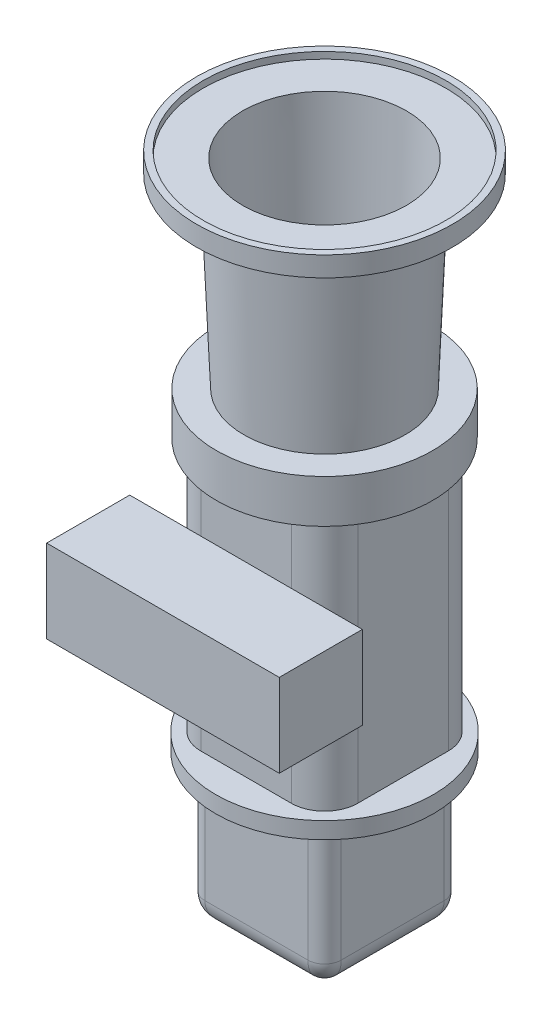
ISO-10303-21;
HEADER;
FILE_DESCRIPTION(('STEP AP214'),'2;1');
FILE_NAME('part.step','',(''),(''),'','','');
FILE_SCHEMA(('AUTOMOTIVE_DESIGN { 1 0 10303 214 1 1 1 1 }'));
ENDSEC;
DATA;
#1=APPLICATION_CONTEXT('core data for automotive mechanical design processes');
#2=APPLICATION_PROTOCOL_DEFINITION('international standard','automotive_design',2000,#1);
#3=PRODUCT_CONTEXT('',#1,'mechanical');
#4=PRODUCT('Part','Part','',(#3));
#5=PRODUCT_RELATED_PRODUCT_CATEGORY('part','',(#4));
#6=PRODUCT_DEFINITION_FORMATION('','',#4);
#7=PRODUCT_DEFINITION_CONTEXT('part definition',#1,'design');
#8=PRODUCT_DEFINITION('design','',#6,#7);
#9=PRODUCT_DEFINITION_SHAPE('','',#8);
#10=(LENGTH_UNIT() NAMED_UNIT(*) SI_UNIT(.MILLI.,.METRE.));
#11=(NAMED_UNIT(*) PLANE_ANGLE_UNIT() SI_UNIT($,.RADIAN.));
#12=(NAMED_UNIT(*) SI_UNIT($,.STERADIAN.) SOLID_ANGLE_UNIT());
#13=UNCERTAINTY_MEASURE_WITH_UNIT(LENGTH_MEASURE(1.E-05),#10,'distance_accuracy_value','');
#14=(GEOMETRIC_REPRESENTATION_CONTEXT(3) GLOBAL_UNCERTAINTY_ASSIGNED_CONTEXT((#13)) GLOBAL_UNIT_ASSIGNED_CONTEXT((#10,
#11,#12)) REPRESENTATION_CONTEXT('',''));
#15=CARTESIAN_POINT('',(0.,0.,0.));
#16=DIRECTION('',(0.,0.,1.));
#17=DIRECTION('',(1.,0.,0.));
#18=AXIS2_PLACEMENT_3D('',#15,#16,#17);
#19=CARTESIAN_POINT('',(0.,-143.2,0.));
#20=DIRECTION('',(0.,1.,0.));
#21=DIRECTION('',(-1.,0.,0.));
#22=AXIS2_PLACEMENT_3D('',#19,#20,#21);
#23=PLANE('',#22);
#24=CARTESIAN_POINT('',(0.,-143.2,0.));
#25=DIRECTION('',(0.,1.,0.));
#26=DIRECTION('',(-1.,0.,0.));
#27=AXIS2_PLACEMENT_3D('',#24,#25,#26);
#28=CIRCLE('',#27,41.25);
#29=CARTESIAN_POINT('',(-41.25,-143.2,0.));
#30=VERTEX_POINT('',#29);
#31=EDGE_CURVE('E455',#30,#30,#28,.T.);
#32=ORIENTED_EDGE('',*,*,#31,.T.);
#33=EDGE_LOOP('',(#32));
#34=FACE_BOUND('',#33,.T.);
#35=CARTESIAN_POINT('',(0.,-143.2,0.));
#36=DIRECTION('',(0.,1.,0.));
#37=DIRECTION('',(-1.,0.,0.));
#38=AXIS2_PLACEMENT_3D('',#35,#36,#37);
#39=CIRCLE('',#38,8.25);
#40=CARTESIAN_POINT('',(8.25000000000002,-143.2,0.));
#41=VERTEX_POINT('',#40);
#42=EDGE_CURVE('E549',#41,#41,#39,.T.);
#43=ORIENTED_EDGE('',*,*,#42,.F.);
#44=EDGE_LOOP('',(#43));
#45=FACE_BOUND('',#44,.T.);
#46=ADVANCED_FACE('F30',(#34,#45),#23,.T.);
#47=CARTESIAN_POINT('',(-27.25,-150.,27.25));
#48=DIRECTION('',(0.,-1.,0.));
#49=DIRECTION('',(1.,0.,0.));
#50=AXIS2_PLACEMENT_3D('',#47,#48,#49);
#51=PLANE('',#50);
#52=CARTESIAN_POINT('',(0.,-150.,0.));
#53=DIRECTION('',(0.,1.,0.));
#54=DIRECTION('',(-1.,0.,0.));
#55=AXIS2_PLACEMENT_3D('',#52,#53,#54);
#56=CIRCLE('',#55,43.4541224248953);
#57=CARTESIAN_POINT('',(-43.4541224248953,-150.,0.));
#58=VERTEX_POINT('',#57);
#59=EDGE_CURVE('E391',#58,#58,#56,.T.);
#60=ORIENTED_EDGE('',*,*,#59,.T.);
#61=EDGE_LOOP('',(#60));
#62=FACE_BOUND('',#61,.T.);
#63=CARTESIAN_POINT('',(0.,-150.,0.));
#64=DIRECTION('',(0.,-1.,0.));
#65=DIRECTION('',(1.,0.,0.));
#66=AXIS2_PLACEMENT_3D('',#63,#64,#65);
#67=CIRCLE('',#66,41.25);
#68=CARTESIAN_POINT('',(41.25,-150.,0.));
#69=VERTEX_POINT('',#68);
#70=EDGE_CURVE('E11',#69,#69,#67,.F.);
#71=ORIENTED_EDGE('',*,*,#70,.F.);
#72=EDGE_LOOP('',(#71));
#73=FACE_BOUND('',#72,.T.);
#74=ADVANCED_FACE('F527',(#62,#73),#51,.F.);
#75=CARTESIAN_POINT('',(0.,-313.,0.));
#76=DIRECTION('',(0.,-1.,0.));
#77=DIRECTION('',(1.,0.,0.));
#78=AXIS2_PLACEMENT_3D('',#75,#76,#77);
#79=PLANE('',#78);
#80=CARTESIAN_POINT('',(0.,-313.,0.));
#81=DIRECTION('',(0.,-1.,0.));
#82=DIRECTION('',(1.,0.,0.));
#83=AXIS2_PLACEMENT_3D('',#80,#81,#82);
#84=CIRCLE('',#83,65.5);
#85=CARTESIAN_POINT('',(65.5000000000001,-313.,0.));
#86=VERTEX_POINT('',#85);
#87=EDGE_CURVE('E251',#86,#86,#84,.T.);
#88=ORIENTED_EDGE('',*,*,#87,.T.);
#89=EDGE_LOOP('',(#88));
#90=FACE_BOUND('',#89,.T.);
#91=DIRECTION('',(0.,0.,-1.));
#92=VECTOR('',#91,1.);
#93=CARTESIAN_POINT('',(-41.,-313.,31.));
#94=LINE('',#93,#92);
#95=CARTESIAN_POINT('',(-41.,-313.,31.));
#96=VERTEX_POINT('',#95);
#97=CARTESIAN_POINT('',(-41.,-313.,-31.));
#98=VERTEX_POINT('',#97);
#99=EDGE_CURVE('E196',#96,#98,#94,.T.);
#100=ORIENTED_EDGE('',*,*,#99,.F.);
#101=CARTESIAN_POINT('',(-31.,-313.,31.));
#102=DIRECTION('',(0.,-1.,0.));
#103=DIRECTION('',(1.,0.,0.));
#104=AXIS2_PLACEMENT_3D('',#101,#102,#103);
#105=CIRCLE('',#104,10.);
#106=CARTESIAN_POINT('',(-31.,-313.,41.));
#107=VERTEX_POINT('',#106);
#108=EDGE_CURVE('E206',#107,#96,#105,.T.);
#109=ORIENTED_EDGE('',*,*,#108,.F.);
#110=DIRECTION('',(-1.,0.,0.));
#111=VECTOR('',#110,1.);
#112=CARTESIAN_POINT('',(-31.,-313.,41.));
#113=LINE('',#112,#111);
#114=CARTESIAN_POINT('',(31.,-313.,41.));
#115=VERTEX_POINT('',#114);
#116=EDGE_CURVE('E235',#115,#107,#113,.T.);
#117=ORIENTED_EDGE('',*,*,#116,.F.);
#118=CARTESIAN_POINT('',(31.,-313.,31.));
#119=DIRECTION('',(0.,-1.,0.));
#120=DIRECTION('',(1.,0.,0.));
#121=AXIS2_PLACEMENT_3D('',#118,#119,#120);
#122=CIRCLE('',#121,10.);
#123=CARTESIAN_POINT('',(41.,-313.,31.));
#124=VERTEX_POINT('',#123);
#125=EDGE_CURVE('E232',#124,#115,#122,.T.);
#126=ORIENTED_EDGE('',*,*,#125,.F.);
#127=DIRECTION('',(0.,0.,1.));
#128=VECTOR('',#127,1.);
#129=CARTESIAN_POINT('',(41.,-313.,31.));
#130=LINE('',#129,#128);
#131=CARTESIAN_POINT('',(41.,-313.,-31.));
#132=VERTEX_POINT('',#131);
#133=EDGE_CURVE('E229',#132,#124,#130,.T.);
#134=ORIENTED_EDGE('',*,*,#133,.F.);
#135=CARTESIAN_POINT('',(31.,-313.,-31.));
#136=DIRECTION('',(0.,-1.,0.));
#137=DIRECTION('',(1.,0.,0.));
#138=AXIS2_PLACEMENT_3D('',#135,#136,#137);
#139=CIRCLE('',#138,10.);
#140=CARTESIAN_POINT('',(31.,-313.,-41.));
#141=VERTEX_POINT('',#140);
#142=EDGE_CURVE('E226',#141,#132,#139,.T.);
#143=ORIENTED_EDGE('',*,*,#142,.F.);
#144=DIRECTION('',(1.,0.,0.));
#145=VECTOR('',#144,1.);
#146=CARTESIAN_POINT('',(-31.,-313.,-41.));
#147=LINE('',#146,#145);
#148=CARTESIAN_POINT('',(-31.,-313.,-41.));
#149=VERTEX_POINT('',#148);
#150=EDGE_CURVE('E220',#149,#141,#147,.T.);
#151=ORIENTED_EDGE('',*,*,#150,.F.);
#152=CARTESIAN_POINT('',(-31.,-313.,-31.));
#153=DIRECTION('',(0.,-1.,0.));
#154=DIRECTION('',(1.,0.,0.));
#155=AXIS2_PLACEMENT_3D('',#152,#153,#154);
#156=CIRCLE('',#155,10.);
#157=EDGE_CURVE('E218',#98,#149,#156,.T.);
#158=ORIENTED_EDGE('',*,*,#157,.F.);
#159=EDGE_LOOP('',(#100,#109,#117,#126,#134,#143,#151,#158));
#160=FACE_BOUND('',#159,.T.);
#161=ADVANCED_FACE('F215',(#90,#160),#79,.T.);
#162=CARTESIAN_POINT('',(-27.25,-303.,47.25));
#163=DIRECTION('',(0.,0.,-1.));
#164=DIRECTION('',(-1.,0.,0.));
#165=AXIS2_PLACEMENT_3D('',#162,#163,#164);
#166=PLANE('',#165);
#167=DIRECTION('',(1.,0.,0.));
#168=VECTOR('',#167,1.);
#169=CARTESIAN_POINT('',(-70.,-241.,47.25));
#170=LINE('',#169,#168);
#171=CARTESIAN_POINT('',(-27.25,-241.,47.25));
#172=VERTEX_POINT('',#171);
#173=CARTESIAN_POINT('',(27.25,-241.,47.25));
#174=VERTEX_POINT('',#173);
#175=EDGE_CURVE('E262',#172,#174,#170,.T.);
#176=ORIENTED_EDGE('',*,*,#175,.F.);
#177=DIRECTION('',(0.,1.,0.));
#178=VECTOR('',#177,1.);
#179=CARTESIAN_POINT('',(-27.25,-303.,47.25));
#180=LINE('',#179,#178);
#181=CARTESIAN_POINT('',(-27.25,-303.,47.25));
#182=VERTEX_POINT('',#181);
#183=EDGE_CURVE('E341',#182,#172,#180,.T.);
#184=ORIENTED_EDGE('',*,*,#183,.F.);
#185=DIRECTION('',(-1.,0.,0.));
#186=VECTOR('',#185,1.);
#187=CARTESIAN_POINT('',(-27.25,-303.,47.25));
#188=LINE('',#187,#186);
#189=CARTESIAN_POINT('',(27.25,-303.,47.25));
#190=VERTEX_POINT('',#189);
#191=EDGE_CURVE('E337',#190,#182,#188,.T.);
#192=ORIENTED_EDGE('',*,*,#191,.F.);
#193=DIRECTION('',(0.,1.,0.));
#194=VECTOR('',#193,1.);
#195=CARTESIAN_POINT('',(27.25,-303.,47.25));
#196=LINE('',#195,#194);
#197=EDGE_CURVE('E346',#190,#174,#196,.T.);
#198=ORIENTED_EDGE('',*,*,#197,.T.);
#199=EDGE_LOOP('',(#176,#184,#192,#198));
#200=FACE_BOUND('',#199,.T.);
#201=ADVANCED_FACE('F698',(#200),#166,.F.);
#202=DIRECTION('',(-1.,0.,0.));
#203=VECTOR('',#202,1.);
#204=CARTESIAN_POINT('',(-70.,-191.,47.25));
#205=LINE('',#204,#203);
#206=CARTESIAN_POINT('',(27.25,-191.,47.25));
#207=VERTEX_POINT('',#206);
#208=CARTESIAN_POINT('',(-27.25,-191.,47.25));
#209=VERTEX_POINT('',#208);
#210=EDGE_CURVE('E269',#207,#209,#205,.T.);
#211=ORIENTED_EDGE('',*,*,#210,.F.);
#212=CARTESIAN_POINT('',(27.25,-150.,47.25));
#213=VERTEX_POINT('',#212);
#214=EDGE_CURVE('E344',#207,#213,#196,.T.);
#215=ORIENTED_EDGE('',*,*,#214,.T.);
#216=DIRECTION('',(-1.,0.,0.));
#217=VECTOR('',#216,1.);
#218=CARTESIAN_POINT('',(-27.25,-150.,47.25));
#219=LINE('',#218,#217);
#220=CARTESIAN_POINT('',(-27.25,-150.,47.25));
#221=VERTEX_POINT('',#220);
#222=EDGE_CURVE('E313',#213,#221,#219,.T.);
#223=ORIENTED_EDGE('',*,*,#222,.T.);
#224=EDGE_CURVE('E340',#209,#221,#180,.T.);
#225=ORIENTED_EDGE('',*,*,#224,.F.);
#226=EDGE_LOOP('',(#211,#215,#223,#225));
#227=FACE_BOUND('',#226,.T.);
#228=ADVANCED_FACE('F789',(#227),#166,.F.);
#229=CARTESIAN_POINT('',(65.,-150.,0.));
#230=DIRECTION('',(0.,1.,0.));
#231=DIRECTION('',(-1.,0.,0.));
#232=AXIS2_PLACEMENT_3D('',#229,#230,#231);
#233=PLANE('',#232);
#234=CARTESIAN_POINT('',(0.,-150.,0.));
#235=DIRECTION('',(0.,1.,0.));
#236=DIRECTION('',(-1.,0.,0.));
#237=AXIS2_PLACEMENT_3D('',#234,#235,#236);
#238=CIRCLE('',#237,65.);
#239=CARTESIAN_POINT('',(-65.,-150.,0.));
#240=VERTEX_POINT('',#239);
#241=EDGE_CURVE('E388',#240,#240,#238,.T.);
#242=ORIENTED_EDGE('',*,*,#241,.F.);
#243=EDGE_LOOP('',(#242));
#244=FACE_BOUND('',#243,.T.);
#245=CARTESIAN_POINT('',(-27.25,-150.,27.25));
#246=DIRECTION('',(0.,-1.,0.));
#247=DIRECTION('',(1.,0.,0.));
#248=AXIS2_PLACEMENT_3D('',#245,#246,#247);
#249=CIRCLE('',#248,20.);
#250=CARTESIAN_POINT('',(-47.25,-150.,27.25));
#251=VERTEX_POINT('',#250);
#252=EDGE_CURVE('E292',#221,#251,#249,.T.);
#253=ORIENTED_EDGE('',*,*,#252,.F.);
#254=ORIENTED_EDGE('',*,*,#222,.F.);
#255=CARTESIAN_POINT('',(27.25,-150.,27.25));
#256=DIRECTION('',(0.,-1.,0.));
#257=DIRECTION('',(1.,0.,0.));
#258=AXIS2_PLACEMENT_3D('',#255,#256,#257);
#259=CIRCLE('',#258,20.);
#260=CARTESIAN_POINT('',(47.25,-150.,27.25));
#261=VERTEX_POINT('',#260);
#262=EDGE_CURVE('E310',#261,#213,#259,.T.);
#263=ORIENTED_EDGE('',*,*,#262,.F.);
#264=DIRECTION('',(0.,0.,1.));
#265=VECTOR('',#264,1.);
#266=CARTESIAN_POINT('',(47.25,-150.,27.25));
#267=LINE('',#266,#265);
#268=CARTESIAN_POINT('',(47.25,-150.,-27.25));
#269=VERTEX_POINT('',#268);
#270=EDGE_CURVE('E307',#269,#261,#267,.T.);
#271=ORIENTED_EDGE('',*,*,#270,.F.);
#272=CARTESIAN_POINT('',(27.25,-150.,-27.25));
#273=DIRECTION('',(0.,-1.,0.));
#274=DIRECTION('',(-1.,0.,0.));
#275=AXIS2_PLACEMENT_3D('',#272,#273,#274);
#276=CIRCLE('',#275,20.);
#277=CARTESIAN_POINT('',(27.25,-150.,-47.25));
#278=VERTEX_POINT('',#277);
#279=EDGE_CURVE('E304',#278,#269,#276,.T.);
#280=ORIENTED_EDGE('',*,*,#279,.F.);
#281=DIRECTION('',(1.,0.,0.));
#282=VECTOR('',#281,1.);
#283=CARTESIAN_POINT('',(-27.25,-150.,-47.25));
#284=LINE('',#283,#282);
#285=CARTESIAN_POINT('',(-27.25,-150.,-47.25));
#286=VERTEX_POINT('',#285);
#287=EDGE_CURVE('E301',#286,#278,#284,.T.);
#288=ORIENTED_EDGE('',*,*,#287,.F.);
#289=CARTESIAN_POINT('',(-27.25,-150.,-27.25));
#290=DIRECTION('',(0.,-1.,0.));
#291=DIRECTION('',(1.,0.,0.));
#292=AXIS2_PLACEMENT_3D('',#289,#290,#291);
#293=CIRCLE('',#292,20.);
#294=CARTESIAN_POINT('',(-47.25,-150.,-27.25));
#295=VERTEX_POINT('',#294);
#296=EDGE_CURVE('E298',#295,#286,#293,.T.);
#297=ORIENTED_EDGE('',*,*,#296,.F.);
#298=DIRECTION('',(0.,0.,-1.));
#299=VECTOR('',#298,1.);
#300=CARTESIAN_POINT('',(-47.25,-150.,27.25));
#301=LINE('',#300,#299);
#302=EDGE_CURVE('E295',#251,#295,#301,.T.);
#303=ORIENTED_EDGE('',*,*,#302,.F.);
#304=EDGE_LOOP('',(#253,#254,#263,#271,#280,#288,#297,#303));
#305=FACE_BOUND('',#304,.T.);
#306=ADVANCED_FACE('F798',(#244,#305),#233,.F.);
#307=CARTESIAN_POINT('',(73.,-4.,0.));
#308=DIRECTION('',(0.,-1.,0.));
#309=DIRECTION('',(1.,0.,0.));
#310=AXIS2_PLACEMENT_3D('',#307,#308,#309);
#311=PLANE('',#310);
#312=CARTESIAN_POINT('',(0.,-4.00000000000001,0.));
#313=DIRECTION('',(0.,1.,0.));
#314=DIRECTION('',(-1.,0.,0.));
#315=AXIS2_PLACEMENT_3D('',#312,#313,#314);
#316=CIRCLE('',#315,49.3180881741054);
#317=CARTESIAN_POINT('',(-49.3180881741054,-4.00000000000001,0.));
#318=VERTEX_POINT('',#317);
#319=EDGE_CURVE('E394',#318,#318,#316,.T.);
#320=ORIENTED_EDGE('',*,*,#319,.F.);
#321=EDGE_LOOP('',(#320));
#322=FACE_BOUND('',#321,.T.);
#323=CARTESIAN_POINT('',(0.,-4.00000000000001,0.));
#324=DIRECTION('',(0.,1.,0.));
#325=DIRECTION('',(-1.,0.,0.));
#326=AXIS2_PLACEMENT_3D('',#323,#324,#325);
#327=CIRCLE('',#326,73.);
#328=CARTESIAN_POINT('',(-73.,-4.00000000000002,0.));
#329=VERTEX_POINT('',#328);
#330=EDGE_CURVE('E367',#329,#329,#327,.T.);
#331=ORIENTED_EDGE('',*,*,#330,.T.);
#332=EDGE_LOOP('',(#331));
#333=FACE_BOUND('',#332,.T.);
#334=ADVANCED_FACE('F32',(#322,#333),#311,.F.);
#335=CARTESIAN_POINT('',(0.,-4.00000000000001,0.));
#336=DIRECTION('',(0.,1.,0.));
#337=DIRECTION('',(-1.,0.,0.));
#338=AXIS2_PLACEMENT_3D('',#335,#336,#337);
#339=CONICAL_SURFACE('',#338,49.3180881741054,0.0401425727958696);
#340=ORIENTED_EDGE('',*,*,#59,.F.);
#341=EDGE_LOOP('',(#340));
#342=FACE_BOUND('',#341,.T.);
#343=ORIENTED_EDGE('',*,*,#319,.T.);
#344=EDGE_LOOP('',(#343));
#345=FACE_BOUND('',#344,.T.);
#346=ADVANCED_FACE('F929',(#342,#345),#339,.F.);
#347=CARTESIAN_POINT('',(0.,0.,0.));
#348=DIRECTION('',(0.,1.,0.));
#349=DIRECTION('',(-1.,0.,0.));
#350=AXIS2_PLACEMENT_3D('',#347,#348,#349);
#351=CYLINDRICAL_SURFACE('',#350,65.);
#352=CARTESIAN_POINT('',(0.,-124.,0.));
#353=DIRECTION('',(0.,1.,0.));
#354=DIRECTION('',(-1.,0.,0.));
#355=AXIS2_PLACEMENT_3D('',#352,#353,#354);
#356=CIRCLE('',#355,65.);
#357=CARTESIAN_POINT('',(-65.,-124.,0.));
#358=VERTEX_POINT('',#357);
#359=EDGE_CURVE('E385',#358,#358,#356,.T.);
#360=ORIENTED_EDGE('',*,*,#359,.F.);
#361=EDGE_LOOP('',(#360));
#362=FACE_BOUND('',#361,.T.);
#363=ORIENTED_EDGE('',*,*,#241,.T.);
#364=EDGE_LOOP('',(#363));
#365=FACE_BOUND('',#364,.T.);
#366=ADVANCED_FACE('F920',(#362,#365),#351,.T.);
#367=CARTESIAN_POINT('',(48.5016153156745,-124.,0.));
#368=DIRECTION('',(0.,-1.,0.));
#369=DIRECTION('',(1.,0.,0.));
#370=AXIS2_PLACEMENT_3D('',#367,#368,#369);
#371=PLANE('',#370);
#372=CARTESIAN_POINT('',(0.,-124.,0.));
#373=DIRECTION('',(0.,1.,0.));
#374=DIRECTION('',(-1.,0.,0.));
#375=AXIS2_PLACEMENT_3D('',#372,#373,#374);
#376=CIRCLE('',#375,48.5016153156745);
#377=CARTESIAN_POINT('',(-48.5016153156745,-124.,0.));
#378=VERTEX_POINT('',#377);
#379=EDGE_CURVE('E382',#378,#378,#376,.T.);
#380=ORIENTED_EDGE('',*,*,#379,.F.);
#381=EDGE_LOOP('',(#380));
#382=FACE_BOUND('',#381,.T.);
#383=ORIENTED_EDGE('',*,*,#359,.T.);
#384=EDGE_LOOP('',(#383));
#385=FACE_BOUND('',#384,.T.);
#386=ADVANCED_FACE('F911',(#382,#385),#371,.F.);
#387=CARTESIAN_POINT('',(0.,-124.,0.));
#388=DIRECTION('',(0.,1.,0.));
#389=DIRECTION('',(-1.,0.,0.));
#390=AXIS2_PLACEMENT_3D('',#387,#388,#389);
#391=CONICAL_SURFACE('',#390,48.5016153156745,0.0401425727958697);
#392=CARTESIAN_POINT('',(0.,-12.,0.));
#393=DIRECTION('',(0.,1.,0.));
#394=DIRECTION('',(-1.,0.,0.));
#395=AXIS2_PLACEMENT_3D('',#392,#393,#394);
#396=CIRCLE('',#395,53.);
#397=CARTESIAN_POINT('',(-53.,-12.,0.));
#398=VERTEX_POINT('',#397);
#399=EDGE_CURVE('E379',#398,#398,#396,.T.);
#400=ORIENTED_EDGE('',*,*,#399,.F.);
#401=EDGE_LOOP('',(#400));
#402=FACE_BOUND('',#401,.T.);
#403=ORIENTED_EDGE('',*,*,#379,.T.);
#404=EDGE_LOOP('',(#403));
#405=FACE_BOUND('',#404,.T.);
#406=ADVANCED_FACE('F902',(#402,#405),#391,.T.);
#407=CARTESIAN_POINT('',(77.,-12.,0.));
#408=DIRECTION('',(0.,1.,0.));
#409=DIRECTION('',(-1.,0.,0.));
#410=AXIS2_PLACEMENT_3D('',#407,#408,#409);
#411=PLANE('',#410);
#412=CARTESIAN_POINT('',(0.,-12.,0.));
#413=DIRECTION('',(0.,1.,0.));
#414=DIRECTION('',(-1.,0.,0.));
#415=AXIS2_PLACEMENT_3D('',#412,#413,#414);
#416=CIRCLE('',#415,77.);
#417=CARTESIAN_POINT('',(-77.,-12.,0.));
#418=VERTEX_POINT('',#417);
#419=EDGE_CURVE('E376',#418,#418,#416,.T.);
#420=ORIENTED_EDGE('',*,*,#419,.F.);
#421=EDGE_LOOP('',(#420));
#422=FACE_BOUND('',#421,.T.);
#423=ORIENTED_EDGE('',*,*,#399,.T.);
#424=EDGE_LOOP('',(#423));
#425=FACE_BOUND('',#424,.T.);
#426=ADVANCED_FACE('F893',(#422,#425),#411,.F.);
#427=CARTESIAN_POINT('',(0.,0.,0.));
#428=DIRECTION('',(0.,1.,0.));
#429=DIRECTION('',(-1.,0.,0.));
#430=AXIS2_PLACEMENT_3D('',#427,#428,#429);
#431=CYLINDRICAL_SURFACE('',#430,77.);
#432=CARTESIAN_POINT('',(0.,0.,0.));
#433=DIRECTION('',(0.,1.,0.));
#434=DIRECTION('',(-1.,0.,0.));
#435=AXIS2_PLACEMENT_3D('',#432,#433,#434);
#436=CIRCLE('',#435,77.);
#437=CARTESIAN_POINT('',(-77.,0.,0.));
#438=VERTEX_POINT('',#437);
#439=EDGE_CURVE('E373',#438,#438,#436,.T.);
#440=ORIENTED_EDGE('',*,*,#439,.F.);
#441=EDGE_LOOP('',(#440));
#442=FACE_BOUND('',#441,.T.);
#443=ORIENTED_EDGE('',*,*,#419,.T.);
#444=EDGE_LOOP('',(#443));
#445=FACE_BOUND('',#444,.T.);
#446=ADVANCED_FACE('F884',(#442,#445),#431,.T.);
#447=CARTESIAN_POINT('',(77.,0.,0.));
#448=DIRECTION('',(0.,-1.,0.));
#449=DIRECTION('',(1.,0.,0.));
#450=AXIS2_PLACEMENT_3D('',#447,#448,#449);
#451=PLANE('',#450);
#452=CARTESIAN_POINT('',(0.,0.,0.));
#453=DIRECTION('',(0.,1.,0.));
#454=DIRECTION('',(-1.,0.,0.));
#455=AXIS2_PLACEMENT_3D('',#452,#453,#454);
#456=CIRCLE('',#455,73.);
#457=CARTESIAN_POINT('',(-73.,0.,0.));
#458=VERTEX_POINT('',#457);
#459=EDGE_CURVE('E370',#458,#458,#456,.T.);
#460=ORIENTED_EDGE('',*,*,#459,.F.);
#461=EDGE_LOOP('',(#460));
#462=FACE_BOUND('',#461,.T.);
#463=ORIENTED_EDGE('',*,*,#439,.T.);
#464=EDGE_LOOP('',(#463));
#465=FACE_BOUND('',#464,.T.);
#466=ADVANCED_FACE('F875',(#462,#465),#451,.F.);
#467=CARTESIAN_POINT('',(0.,0.,0.));
#468=DIRECTION('',(0.,1.,0.));
#469=DIRECTION('',(-1.,0.,0.));
#470=AXIS2_PLACEMENT_3D('',#467,#468,#469);
#471=CYLINDRICAL_SURFACE('',#470,73.);
#472=ORIENTED_EDGE('',*,*,#330,.F.);
#473=EDGE_LOOP('',(#472));
#474=FACE_BOUND('',#473,.T.);
#475=ORIENTED_EDGE('',*,*,#459,.T.);
#476=EDGE_LOOP('',(#475));
#477=FACE_BOUND('',#476,.T.);
#478=ADVANCED_FACE('F859',(#474,#477),#471,.F.);
#479=CARTESIAN_POINT('',(27.25,-303.,27.25));
#480=DIRECTION('',(0.,1.,0.));
#481=DIRECTION('',(-1.,0.,0.));
#482=AXIS2_PLACEMENT_3D('',#479,#480,#481);
#483=CYLINDRICAL_SURFACE('',#482,20.);
#484=ORIENTED_EDGE('',*,*,#262,.T.);
#485=ORIENTED_EDGE('',*,*,#214,.F.);
#486=DIRECTION('',(0.,1.,0.));
#487=VECTOR('',#486,1.);
#488=CARTESIAN_POINT('',(27.25,-303.,47.25));
#489=LINE('',#488,#487);
#490=EDGE_CURVE('E290',#174,#207,#489,.T.);
#491=ORIENTED_EDGE('',*,*,#490,.F.);
#492=ORIENTED_EDGE('',*,*,#197,.F.);
#493=CARTESIAN_POINT('',(27.25,-303.,27.25));
#494=DIRECTION('',(0.,-1.,0.));
#495=DIRECTION('',(1.,0.,0.));
#496=AXIS2_PLACEMENT_3D('',#493,#494,#495);
#497=CIRCLE('',#496,20.);
#498=CARTESIAN_POINT('',(47.25,-303.,27.25));
#499=VERTEX_POINT('',#498);
#500=EDGE_CURVE('E334',#499,#190,#497,.T.);
#501=ORIENTED_EDGE('',*,*,#500,.F.);
#502=DIRECTION('',(0.,1.,0.));
#503=VECTOR('',#502,1.);
#504=CARTESIAN_POINT('',(47.25,-303.,27.25));
#505=LINE('',#504,#503);
#506=EDGE_CURVE('E349',#499,#261,#505,.T.);
#507=ORIENTED_EDGE('',*,*,#506,.T.);
#508=EDGE_LOOP('',(#484,#485,#491,#492,#501,#507));
#509=FACE_BOUND('',#508,.T.);
#510=ADVANCED_FACE('F851',(#509),#483,.T.);
#511=CARTESIAN_POINT('',(47.25,-303.,27.25));
#512=DIRECTION('',(-1.,0.,0.));
#513=DIRECTION('',(0.,0.,1.));
#514=AXIS2_PLACEMENT_3D('',#511,#512,#513);
#515=PLANE('',#514);
#516=ORIENTED_EDGE('',*,*,#270,.T.);
#517=ORIENTED_EDGE('',*,*,#506,.F.);
#518=DIRECTION('',(0.,0.,1.));
#519=VECTOR('',#518,1.);
#520=CARTESIAN_POINT('',(47.25,-303.,27.25));
#521=LINE('',#520,#519);
#522=CARTESIAN_POINT('',(47.25,-303.,-27.25));
#523=VERTEX_POINT('',#522);
#524=EDGE_CURVE('E331',#523,#499,#521,.T.);
#525=ORIENTED_EDGE('',*,*,#524,.F.);
#526=DIRECTION('',(0.,1.,0.));
#527=VECTOR('',#526,1.);
#528=CARTESIAN_POINT('',(47.25,-303.,-27.25));
#529=LINE('',#528,#527);
#530=EDGE_CURVE('E352',#523,#269,#529,.T.);
#531=ORIENTED_EDGE('',*,*,#530,.T.);
#532=EDGE_LOOP('',(#516,#517,#525,#531));
#533=FACE_BOUND('',#532,.T.);
#534=ADVANCED_FACE('F842',(#533),#515,.F.);
#535=CARTESIAN_POINT('',(27.25,-303.,-27.25));
#536=DIRECTION('',(0.,1.,0.));
#537=DIRECTION('',(-1.,0.,0.));
#538=AXIS2_PLACEMENT_3D('',#535,#536,#537);
#539=CYLINDRICAL_SURFACE('',#538,20.);
#540=ORIENTED_EDGE('',*,*,#279,.T.);
#541=ORIENTED_EDGE('',*,*,#530,.F.);
#542=CARTESIAN_POINT('',(27.25,-303.,-27.25));
#543=DIRECTION('',(0.,-1.,0.));
#544=DIRECTION('',(-1.,0.,0.));
#545=AXIS2_PLACEMENT_3D('',#542,#543,#544);
#546=CIRCLE('',#545,20.);
#547=CARTESIAN_POINT('',(27.2500000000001,-303.,-47.25));
#548=VERTEX_POINT('',#547);
#549=EDGE_CURVE('E328',#548,#523,#546,.T.);
#550=ORIENTED_EDGE('',*,*,#549,.F.);
#551=DIRECTION('',(0.,1.,0.));
#552=VECTOR('',#551,1.);
#553=CARTESIAN_POINT('',(27.2500000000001,-303.,-47.25));
#554=LINE('',#553,#552);
#555=EDGE_CURVE('E355',#548,#278,#554,.T.);
#556=ORIENTED_EDGE('',*,*,#555,.T.);
#557=EDGE_LOOP('',(#540,#541,#550,#556));
#558=FACE_BOUND('',#557,.T.);
#559=ADVANCED_FACE('F833',(#558),#539,.T.);
#560=CARTESIAN_POINT('',(-27.25,-303.,-47.25));
#561=DIRECTION('',(0.,0.,1.));
#562=DIRECTION('',(1.,0.,0.));
#563=AXIS2_PLACEMENT_3D('',#560,#561,#562);
#564=PLANE('',#563);
#565=ORIENTED_EDGE('',*,*,#287,.T.);
#566=ORIENTED_EDGE('',*,*,#555,.F.);
#567=DIRECTION('',(1.,0.,0.));
#568=VECTOR('',#567,1.);
#569=CARTESIAN_POINT('',(-27.25,-303.,-47.25));
#570=LINE('',#569,#568);
#571=CARTESIAN_POINT('',(-27.25,-303.,-47.25));
#572=VERTEX_POINT('',#571);
#573=EDGE_CURVE('E325',#572,#548,#570,.T.);
#574=ORIENTED_EDGE('',*,*,#573,.F.);
#575=DIRECTION('',(0.,1.,0.));
#576=VECTOR('',#575,1.);
#577=CARTESIAN_POINT('',(-27.25,-303.,-47.25));
#578=LINE('',#577,#576);
#579=EDGE_CURVE('E358',#572,#286,#578,.T.);
#580=ORIENTED_EDGE('',*,*,#579,.T.);
#581=EDGE_LOOP('',(#565,#566,#574,#580));
#582=FACE_BOUND('',#581,.T.);
#583=ADVANCED_FACE('F824',(#582),#564,.F.);
#584=CARTESIAN_POINT('',(-27.25,-303.,-27.25));
#585=DIRECTION('',(0.,1.,0.));
#586=DIRECTION('',(-1.,0.,0.));
#587=AXIS2_PLACEMENT_3D('',#584,#585,#586);
#588=CYLINDRICAL_SURFACE('',#587,20.);
#589=ORIENTED_EDGE('',*,*,#296,.T.);
#590=ORIENTED_EDGE('',*,*,#579,.F.);
#591=CARTESIAN_POINT('',(-27.25,-303.,-27.25));
#592=DIRECTION('',(0.,-1.,0.));
#593=DIRECTION('',(1.,0.,0.));
#594=AXIS2_PLACEMENT_3D('',#591,#592,#593);
#595=CIRCLE('',#594,20.);
#596=CARTESIAN_POINT('',(-47.25,-303.,-27.25));
#597=VERTEX_POINT('',#596);
#598=EDGE_CURVE('E322',#597,#572,#595,.T.);
#599=ORIENTED_EDGE('',*,*,#598,.F.);
#600=DIRECTION('',(0.,1.,0.));
#601=VECTOR('',#600,1.);
#602=CARTESIAN_POINT('',(-47.25,-303.,-27.25));
#603=LINE('',#602,#601);
#604=EDGE_CURVE('E361',#597,#295,#603,.T.);
#605=ORIENTED_EDGE('',*,*,#604,.T.);
#606=EDGE_LOOP('',(#589,#590,#599,#605));
#607=FACE_BOUND('',#606,.T.);
#608=ADVANCED_FACE('F815',(#607),#588,.T.);
#609=CARTESIAN_POINT('',(-47.25,-303.,27.25));
#610=DIRECTION('',(1.,0.,0.));
#611=DIRECTION('',(0.,1.,0.));
#612=AXIS2_PLACEMENT_3D('',#609,#610,#611);
#613=PLANE('',#612);
#614=ORIENTED_EDGE('',*,*,#302,.T.);
#615=ORIENTED_EDGE('',*,*,#604,.F.);
#616=DIRECTION('',(0.,0.,-1.));
#617=VECTOR('',#616,1.);
#618=CARTESIAN_POINT('',(-47.25,-303.,27.25));
#619=LINE('',#618,#617);
#620=CARTESIAN_POINT('',(-47.25,-303.,27.25));
#621=VERTEX_POINT('',#620);
#622=EDGE_CURVE('E319',#621,#597,#619,.T.);
#623=ORIENTED_EDGE('',*,*,#622,.F.);
#624=DIRECTION('',(0.,1.,0.));
#625=VECTOR('',#624,1.);
#626=CARTESIAN_POINT('',(-47.25,-303.,27.25));
#627=LINE('',#626,#625);
#628=EDGE_CURVE('E364',#621,#251,#627,.T.);
#629=ORIENTED_EDGE('',*,*,#628,.T.);
#630=EDGE_LOOP('',(#614,#615,#623,#629));
#631=FACE_BOUND('',#630,.T.);
#632=ADVANCED_FACE('F806',(#631),#613,.F.);
#633=CARTESIAN_POINT('',(-27.25,-303.,27.25));
#634=DIRECTION('',(0.,1.,0.));
#635=DIRECTION('',(-1.,0.,0.));
#636=AXIS2_PLACEMENT_3D('',#633,#634,#635);
#637=CYLINDRICAL_SURFACE('',#636,20.);
#638=ORIENTED_EDGE('',*,*,#252,.T.);
#639=ORIENTED_EDGE('',*,*,#628,.F.);
#640=CARTESIAN_POINT('',(-27.25,-303.,27.25));
#641=DIRECTION('',(0.,-1.,0.));
#642=DIRECTION('',(1.,0.,0.));
#643=AXIS2_PLACEMENT_3D('',#640,#641,#642);
#644=CIRCLE('',#643,20.);
#645=EDGE_CURVE('E316',#182,#621,#644,.T.);
#646=ORIENTED_EDGE('',*,*,#645,.F.);
#647=ORIENTED_EDGE('',*,*,#183,.T.);
#648=EDGE_CURVE('E345',#172,#209,#180,.T.);
#649=ORIENTED_EDGE('',*,*,#648,.T.);
#650=ORIENTED_EDGE('',*,*,#224,.T.);
#651=EDGE_LOOP('',(#638,#639,#646,#647,#649,#650));
#652=FACE_BOUND('',#651,.T.);
#653=ADVANCED_FACE('F781',(#652),#637,.T.);
#654=CARTESIAN_POINT('',(-70.,-241.,47.25));
#655=DIRECTION('',(0.,0.,1.));
#656=DIRECTION('',(1.,0.,0.));
#657=AXIS2_PLACEMENT_3D('',#654,#655,#656);
#658=PLANE('',#657);
#659=CARTESIAN_POINT('',(70.,-241.,47.25));
#660=VERTEX_POINT('',#659);
#661=EDGE_CURVE('E257',#174,#660,#170,.T.);
#662=ORIENTED_EDGE('',*,*,#661,.F.);
#663=ORIENTED_EDGE('',*,*,#490,.T.);
#664=CARTESIAN_POINT('',(70.,-191.,47.25));
#665=VERTEX_POINT('',#664);
#666=EDGE_CURVE('E265',#665,#207,#205,.T.);
#667=ORIENTED_EDGE('',*,*,#666,.F.);
#668=DIRECTION('',(0.,1.,0.));
#669=VECTOR('',#668,1.);
#670=CARTESIAN_POINT('',(70.,-191.,47.25));
#671=LINE('',#670,#669);
#672=EDGE_CURVE('E261',#660,#665,#671,.T.);
#673=ORIENTED_EDGE('',*,*,#672,.F.);
#674=EDGE_LOOP('',(#662,#663,#667,#673));
#675=FACE_BOUND('',#674,.T.);
#676=ADVANCED_FACE('F729',(#675),#658,.F.);
#677=CARTESIAN_POINT('',(-70.,-191.,97.25));
#678=DIRECTION('',(1.,0.,0.));
#679=DIRECTION('',(0.,0.,-1.));
#680=AXIS2_PLACEMENT_3D('',#677,#678,#679);
#681=PLANE('',#680);
#682=DIRECTION('',(0.,-1.,0.));
#683=VECTOR('',#682,1.);
#684=CARTESIAN_POINT('',(-70.,-191.,47.25));
#685=LINE('',#684,#683);
#686=CARTESIAN_POINT('',(-70.,-191.,47.25));
#687=VERTEX_POINT('',#686);
#688=CARTESIAN_POINT('',(-70.,-241.,47.25));
#689=VERTEX_POINT('',#688);
#690=EDGE_CURVE('E254',#687,#689,#685,.T.);
#691=ORIENTED_EDGE('',*,*,#690,.T.);
#692=DIRECTION('',(0.,0.,-1.));
#693=VECTOR('',#692,1.);
#694=CARTESIAN_POINT('',(-70.,-241.,97.25));
#695=LINE('',#694,#693);
#696=CARTESIAN_POINT('',(-70.,-241.,97.25));
#697=VERTEX_POINT('',#696);
#698=EDGE_CURVE('E287',#697,#689,#695,.T.);
#699=ORIENTED_EDGE('',*,*,#698,.F.);
#700=DIRECTION('',(0.,-1.,0.));
#701=VECTOR('',#700,1.);
#702=CARTESIAN_POINT('',(-70.,-191.,97.25));
#703=LINE('',#702,#701);
#704=CARTESIAN_POINT('',(-70.,-191.,97.25));
#705=VERTEX_POINT('',#704);
#706=EDGE_CURVE('E268',#705,#697,#703,.T.);
#707=ORIENTED_EDGE('',*,*,#706,.F.);
#708=DIRECTION('',(0.,0.,-1.));
#709=VECTOR('',#708,1.);
#710=CARTESIAN_POINT('',(-70.,-191.,97.25));
#711=LINE('',#710,#709);
#712=EDGE_CURVE('E278',#705,#687,#711,.T.);
#713=ORIENTED_EDGE('',*,*,#712,.T.);
#714=EDGE_LOOP('',(#691,#699,#707,#713));
#715=FACE_BOUND('',#714,.T.);
#716=ADVANCED_FACE('F764',(#715),#681,.F.);
#717=CARTESIAN_POINT('',(-70.,-241.,97.25));
#718=DIRECTION('',(0.,1.,0.));
#719=DIRECTION('',(-1.,0.,0.));
#720=AXIS2_PLACEMENT_3D('',#717,#718,#719);
#721=PLANE('',#720);
#722=EDGE_CURVE('E258',#689,#172,#170,.T.);
#723=ORIENTED_EDGE('',*,*,#722,.T.);
#724=ORIENTED_EDGE('',*,*,#175,.T.);
#725=ORIENTED_EDGE('',*,*,#661,.T.);
#726=DIRECTION('',(0.,0.,-1.));
#727=VECTOR('',#726,1.);
#728=CARTESIAN_POINT('',(70.,-241.,97.25));
#729=LINE('',#728,#727);
#730=CARTESIAN_POINT('',(70.,-241.,97.25));
#731=VERTEX_POINT('',#730);
#732=EDGE_CURVE('E284',#731,#660,#729,.T.);
#733=ORIENTED_EDGE('',*,*,#732,.F.);
#734=DIRECTION('',(1.,0.,0.));
#735=VECTOR('',#734,1.);
#736=CARTESIAN_POINT('',(-70.,-241.,97.25));
#737=LINE('',#736,#735);
#738=EDGE_CURVE('E272',#697,#731,#737,.T.);
#739=ORIENTED_EDGE('',*,*,#738,.F.);
#740=ORIENTED_EDGE('',*,*,#698,.T.);
#741=EDGE_LOOP('',(#723,#724,#725,#733,#739,#740));
#742=FACE_BOUND('',#741,.T.);
#743=ADVANCED_FACE('F755',(#742),#721,.F.);
#744=CARTESIAN_POINT('',(70.,-191.,97.25));
#745=DIRECTION('',(-1.,0.,0.));
#746=DIRECTION('',(0.,-1.,0.));
#747=AXIS2_PLACEMENT_3D('',#744,#745,#746);
#748=PLANE('',#747);
#749=ORIENTED_EDGE('',*,*,#672,.T.);
#750=DIRECTION('',(0.,0.,-1.));
#751=VECTOR('',#750,1.);
#752=CARTESIAN_POINT('',(70.,-191.,97.25));
#753=LINE('',#752,#751);
#754=CARTESIAN_POINT('',(70.,-191.,97.25));
#755=VERTEX_POINT('',#754);
#756=EDGE_CURVE('E281',#755,#665,#753,.T.);
#757=ORIENTED_EDGE('',*,*,#756,.F.);
#758=DIRECTION('',(0.,1.,0.));
#759=VECTOR('',#758,1.);
#760=CARTESIAN_POINT('',(70.,-191.,97.25));
#761=LINE('',#760,#759);
#762=EDGE_CURVE('E274',#731,#755,#761,.T.);
#763=ORIENTED_EDGE('',*,*,#762,.F.);
#764=ORIENTED_EDGE('',*,*,#732,.T.);
#765=EDGE_LOOP('',(#749,#757,#763,#764));
#766=FACE_BOUND('',#765,.T.);
#767=ADVANCED_FACE('F746',(#766),#748,.F.);
#768=CARTESIAN_POINT('',(-70.,-191.,97.25));
#769=DIRECTION('',(0.,-1.,0.));
#770=DIRECTION('',(1.,0.,0.));
#771=AXIS2_PLACEMENT_3D('',#768,#769,#770);
#772=PLANE('',#771);
#773=ORIENTED_EDGE('',*,*,#666,.T.);
#774=ORIENTED_EDGE('',*,*,#210,.T.);
#775=EDGE_CURVE('E264',#209,#687,#205,.T.);
#776=ORIENTED_EDGE('',*,*,#775,.T.);
#777=ORIENTED_EDGE('',*,*,#712,.F.);
#778=DIRECTION('',(-1.,0.,0.));
#779=VECTOR('',#778,1.);
#780=CARTESIAN_POINT('',(-70.,-191.,97.25));
#781=LINE('',#780,#779);
#782=EDGE_CURVE('E276',#755,#705,#781,.T.);
#783=ORIENTED_EDGE('',*,*,#782,.F.);
#784=ORIENTED_EDGE('',*,*,#756,.T.);
#785=EDGE_LOOP('',(#773,#774,#776,#777,#783,#784));
#786=FACE_BOUND('',#785,.T.);
#787=ADVANCED_FACE('F737',(#786),#772,.F.);
#788=CARTESIAN_POINT('',(-70.,-241.,97.25));
#789=DIRECTION('',(0.,0.,1.));
#790=DIRECTION('',(1.,0.,0.));
#791=AXIS2_PLACEMENT_3D('',#788,#789,#790);
#792=PLANE('',#791);
#793=ORIENTED_EDGE('',*,*,#706,.T.);
#794=ORIENTED_EDGE('',*,*,#738,.T.);
#795=ORIENTED_EDGE('',*,*,#762,.T.);
#796=ORIENTED_EDGE('',*,*,#782,.T.);
#797=EDGE_LOOP('',(#793,#794,#795,#796));
#798=FACE_BOUND('',#797,.T.);
#799=ADVANCED_FACE('F726',(#798),#792,.T.);
#800=ORIENTED_EDGE('',*,*,#648,.F.);
#801=ORIENTED_EDGE('',*,*,#722,.F.);
#802=ORIENTED_EDGE('',*,*,#690,.F.);
#803=ORIENTED_EDGE('',*,*,#775,.F.);
#804=EDGE_LOOP('',(#800,#801,#802,#803));
#805=FACE_BOUND('',#804,.T.);
#806=ADVANCED_FACE('F716',(#805),#658,.F.);
#807=CARTESIAN_POINT('',(0.,-303.,0.));
#808=DIRECTION('',(0.,-1.,0.));
#809=DIRECTION('',(1.,0.,0.));
#810=AXIS2_PLACEMENT_3D('',#807,#808,#809);
#811=PLANE('',#810);
#812=CARTESIAN_POINT('',(0.,-303.,0.));
#813=DIRECTION('',(0.,-1.,0.));
#814=DIRECTION('',(1.,0.,0.));
#815=AXIS2_PLACEMENT_3D('',#812,#813,#814);
#816=CIRCLE('',#815,65.5);
#817=CARTESIAN_POINT('',(65.5,-303.,0.));
#818=VERTEX_POINT('',#817);
#819=EDGE_CURVE('E202',#818,#818,#816,.T.);
#820=ORIENTED_EDGE('',*,*,#819,.F.);
#821=EDGE_LOOP('',(#820));
#822=FACE_BOUND('',#821,.T.);
#823=ORIENTED_EDGE('',*,*,#500,.T.);
#824=ORIENTED_EDGE('',*,*,#191,.T.);
#825=ORIENTED_EDGE('',*,*,#645,.T.);
#826=ORIENTED_EDGE('',*,*,#622,.T.);
#827=ORIENTED_EDGE('',*,*,#598,.T.);
#828=ORIENTED_EDGE('',*,*,#573,.T.);
#829=ORIENTED_EDGE('',*,*,#549,.T.);
#830=ORIENTED_EDGE('',*,*,#524,.T.);
#831=EDGE_LOOP('',(#823,#824,#825,#826,#827,#828,#829,#830));
#832=FACE_BOUND('',#831,.T.);
#833=ADVANCED_FACE('F707',(#822,#832),#811,.F.);
#834=CARTESIAN_POINT('',(0.,-313.,0.));
#835=DIRECTION('',(0.,1.,0.));
#836=DIRECTION('',(-1.,0.,0.));
#837=AXIS2_PLACEMENT_3D('',#834,#835,#836);
#838=CYLINDRICAL_SURFACE('',#837,65.5);
#839=ORIENTED_EDGE('',*,*,#87,.F.);
#840=EDGE_LOOP('',(#839));
#841=FACE_BOUND('',#840,.T.);
#842=ORIENTED_EDGE('',*,*,#819,.T.);
#843=EDGE_LOOP('',(#842));
#844=FACE_BOUND('',#843,.T.);
#845=ADVANCED_FACE('F690',(#841,#844),#838,.T.);
#846=CARTESIAN_POINT('',(-31.,-401.,31.));
#847=DIRECTION('',(0.,1.,0.));
#848=DIRECTION('',(-1.,0.,0.));
#849=AXIS2_PLACEMENT_3D('',#846,#847,#848);
#850=CYLINDRICAL_SURFACE('',#849,10.);
#851=DIRECTION('',(0.,1.,0.));
#852=VECTOR('',#851,1.);
#853=CARTESIAN_POINT('',(-41.,-401.,31.));
#854=LINE('',#853,#852);
#855=CARTESIAN_POINT('',(-41.,-386.,31.));
#856=VERTEX_POINT('',#855);
#857=EDGE_CURVE('E192',#856,#96,#854,.T.);
#858=ORIENTED_EDGE('',*,*,#857,.F.);
#859=CARTESIAN_POINT('',(-31.,-386.,31.));
#860=DIRECTION('',(0.,1.,0.));
#861=DIRECTION('',(0.,0.,1.));
#862=AXIS2_PLACEMENT_3D('',#859,#860,#861);
#863=CIRCLE('',#862,10.);
#864=CARTESIAN_POINT('',(-31.,-386.,41.));
#865=VERTEX_POINT('',#864);
#866=EDGE_CURVE('E397',#856,#865,#863,.T.);
#867=ORIENTED_EDGE('',*,*,#866,.T.);
#868=DIRECTION('',(0.,1.,0.));
#869=VECTOR('',#868,1.);
#870=CARTESIAN_POINT('',(-31.,-401.,41.));
#871=LINE('',#870,#869);
#872=EDGE_CURVE('E209',#865,#107,#871,.T.);
#873=ORIENTED_EDGE('',*,*,#872,.T.);
#874=ORIENTED_EDGE('',*,*,#108,.T.);
#875=EDGE_LOOP('',(#858,#867,#873,#874));
#876=FACE_BOUND('',#875,.T.);
#877=ADVANCED_FACE('F207',(#876),#850,.T.);
#878=CARTESIAN_POINT('',(-41.,-401.,31.));
#879=DIRECTION('',(1.,0.,0.));
#880=DIRECTION('',(0.,0.,-1.));
#881=AXIS2_PLACEMENT_3D('',#878,#879,#880);
#882=PLANE('',#881);
#883=DIRECTION('',(0.,1.,0.));
#884=VECTOR('',#883,1.);
#885=CARTESIAN_POINT('',(-41.,-401.,-31.));
#886=LINE('',#885,#884);
#887=CARTESIAN_POINT('',(-41.,-386.,-31.));
#888=VERTEX_POINT('',#887);
#889=EDGE_CURVE('E203',#888,#98,#886,.T.);
#890=ORIENTED_EDGE('',*,*,#889,.F.);
#891=DIRECTION('',(0.,0.,-1.));
#892=VECTOR('',#891,1.);
#893=CARTESIAN_POINT('',(-41.,-386.,31.));
#894=LINE('',#893,#892);
#895=EDGE_CURVE('E38',#888,#856,#894,.F.);
#896=ORIENTED_EDGE('',*,*,#895,.T.);
#897=ORIENTED_EDGE('',*,*,#857,.T.);
#898=ORIENTED_EDGE('',*,*,#99,.T.);
#899=EDGE_LOOP('',(#890,#896,#897,#898));
#900=FACE_BOUND('',#899,.T.);
#901=ADVANCED_FACE('F194',(#900),#882,.F.);
#902=CARTESIAN_POINT('',(-31.,-401.,-31.));
#903=DIRECTION('',(0.,1.,0.));
#904=DIRECTION('',(-1.,0.,0.));
#905=AXIS2_PLACEMENT_3D('',#902,#903,#904);
#906=CYLINDRICAL_SURFACE('',#905,10.);
#907=DIRECTION('',(0.,1.,0.));
#908=VECTOR('',#907,1.);
#909=CARTESIAN_POINT('',(-31.,-401.,-41.));
#910=LINE('',#909,#908);
#911=CARTESIAN_POINT('',(-31.,-386.,-41.));
#912=VERTEX_POINT('',#911);
#913=EDGE_CURVE('E246',#912,#149,#910,.T.);
#914=ORIENTED_EDGE('',*,*,#913,.F.);
#915=CARTESIAN_POINT('',(-31.,-386.,-31.));
#916=DIRECTION('',(0.,1.,0.));
#917=DIRECTION('',(0.,0.,1.));
#918=AXIS2_PLACEMENT_3D('',#915,#916,#917);
#919=CIRCLE('',#918,10.);
#920=EDGE_CURVE('E45',#912,#888,#919,.T.);
#921=ORIENTED_EDGE('',*,*,#920,.T.);
#922=ORIENTED_EDGE('',*,*,#889,.T.);
#923=ORIENTED_EDGE('',*,*,#157,.T.);
#924=EDGE_LOOP('',(#914,#921,#922,#923));
#925=FACE_BOUND('',#924,.T.);
#926=ADVANCED_FACE('F668',(#925),#906,.T.);
#927=CARTESIAN_POINT('',(-31.,-401.,-41.));
#928=DIRECTION('',(0.,0.,1.));
#929=DIRECTION('',(1.,0.,0.));
#930=AXIS2_PLACEMENT_3D('',#927,#928,#929);
#931=PLANE('',#930);
#932=DIRECTION('',(0.,1.,0.));
#933=VECTOR('',#932,1.);
#934=CARTESIAN_POINT('',(31.,-401.,-41.));
#935=LINE('',#934,#933);
#936=CARTESIAN_POINT('',(31.,-386.,-41.));
#937=VERTEX_POINT('',#936);
#938=EDGE_CURVE('E244',#937,#141,#935,.T.);
#939=ORIENTED_EDGE('',*,*,#938,.F.);
#940=DIRECTION('',(1.,0.,0.));
#941=VECTOR('',#940,1.);
#942=CARTESIAN_POINT('',(-31.,-386.,-41.));
#943=LINE('',#942,#941);
#944=EDGE_CURVE('E53',#937,#912,#943,.F.);
#945=ORIENTED_EDGE('',*,*,#944,.T.);
#946=ORIENTED_EDGE('',*,*,#913,.T.);
#947=ORIENTED_EDGE('',*,*,#150,.T.);
#948=EDGE_LOOP('',(#939,#945,#946,#947));
#949=FACE_BOUND('',#948,.T.);
#950=ADVANCED_FACE('F425',(#949),#931,.F.);
#951=CARTESIAN_POINT('',(31.0000000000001,-401.,-31.));
#952=DIRECTION('',(0.,1.,0.));
#953=DIRECTION('',(-1.,0.,0.));
#954=AXIS2_PLACEMENT_3D('',#951,#952,#953);
#955=CYLINDRICAL_SURFACE('',#954,10.);
#956=DIRECTION('',(0.,1.,0.));
#957=VECTOR('',#956,1.);
#958=CARTESIAN_POINT('',(41.,-401.,-31.));
#959=LINE('',#958,#957);
#960=CARTESIAN_POINT('',(41.,-386.,-31.));
#961=VERTEX_POINT('',#960);
#962=EDGE_CURVE('E242',#961,#132,#959,.T.);
#963=ORIENTED_EDGE('',*,*,#962,.F.);
#964=CARTESIAN_POINT('',(31.,-386.,-31.));
#965=DIRECTION('',(0.,1.,0.));
#966=DIRECTION('',(0.,0.,1.));
#967=AXIS2_PLACEMENT_3D('',#964,#965,#966);
#968=CIRCLE('',#967,10.);
#969=EDGE_CURVE('E414',#961,#937,#968,.T.);
#970=ORIENTED_EDGE('',*,*,#969,.T.);
#971=ORIENTED_EDGE('',*,*,#938,.T.);
#972=ORIENTED_EDGE('',*,*,#142,.T.);
#973=EDGE_LOOP('',(#963,#970,#971,#972));
#974=FACE_BOUND('',#973,.T.);
#975=ADVANCED_FACE('F420',(#974),#955,.T.);
#976=CARTESIAN_POINT('',(41.,-401.,31.));
#977=DIRECTION('',(-1.,0.,0.));
#978=DIRECTION('',(0.,0.,1.));
#979=AXIS2_PLACEMENT_3D('',#976,#977,#978);
#980=PLANE('',#979);
#981=DIRECTION('',(0.,1.,0.));
#982=VECTOR('',#981,1.);
#983=CARTESIAN_POINT('',(41.,-401.,31.));
#984=LINE('',#983,#982);
#985=CARTESIAN_POINT('',(41.,-386.,31.));
#986=VERTEX_POINT('',#985);
#987=EDGE_CURVE('E240',#986,#124,#984,.T.);
#988=ORIENTED_EDGE('',*,*,#987,.F.);
#989=DIRECTION('',(0.,0.,1.));
#990=VECTOR('',#989,1.);
#991=CARTESIAN_POINT('',(41.,-386.,-31.));
#992=LINE('',#991,#990);
#993=EDGE_CURVE('E412',#986,#961,#992,.F.);
#994=ORIENTED_EDGE('',*,*,#993,.T.);
#995=ORIENTED_EDGE('',*,*,#962,.T.);
#996=ORIENTED_EDGE('',*,*,#133,.T.);
#997=EDGE_LOOP('',(#988,#994,#995,#996));
#998=FACE_BOUND('',#997,.T.);
#999=ADVANCED_FACE('F470',(#998),#980,.F.);
#1000=CARTESIAN_POINT('',(31.,-401.,31.));
#1001=DIRECTION('',(0.,1.,0.));
#1002=DIRECTION('',(-1.,0.,0.));
#1003=AXIS2_PLACEMENT_3D('',#1000,#1001,#1002);
#1004=CYLINDRICAL_SURFACE('',#1003,10.);
#1005=DIRECTION('',(0.,1.,0.));
#1006=VECTOR('',#1005,1.);
#1007=CARTESIAN_POINT('',(31.,-401.,41.));
#1008=LINE('',#1007,#1006);
#1009=CARTESIAN_POINT('',(31.,-386.,41.));
#1010=VERTEX_POINT('',#1009);
#1011=EDGE_CURVE('E238',#1010,#115,#1008,.T.);
#1012=ORIENTED_EDGE('',*,*,#1011,.F.);
#1013=CARTESIAN_POINT('',(31.,-386.,31.));
#1014=DIRECTION('',(0.,1.,0.));
#1015=DIRECTION('',(0.,0.,1.));
#1016=AXIS2_PLACEMENT_3D('',#1013,#1014,#1015);
#1017=CIRCLE('',#1016,10.);
#1018=EDGE_CURVE('E410',#1010,#986,#1017,.T.);
#1019=ORIENTED_EDGE('',*,*,#1018,.T.);
#1020=ORIENTED_EDGE('',*,*,#987,.T.);
#1021=ORIENTED_EDGE('',*,*,#125,.T.);
#1022=EDGE_LOOP('',(#1012,#1019,#1020,#1021));
#1023=FACE_BOUND('',#1022,.T.);
#1024=ADVANCED_FACE('F465',(#1023),#1004,.T.);
#1025=CARTESIAN_POINT('',(-31.,-401.,41.));
#1026=DIRECTION('',(0.,0.,-1.));
#1027=DIRECTION('',(-1.,0.,0.));
#1028=AXIS2_PLACEMENT_3D('',#1025,#1026,#1027);
#1029=PLANE('',#1028);
#1030=ORIENTED_EDGE('',*,*,#872,.F.);
#1031=DIRECTION('',(-1.,0.,0.));
#1032=VECTOR('',#1031,1.);
#1033=CARTESIAN_POINT('',(31.,-386.,41.));
#1034=LINE('',#1033,#1032);
#1035=EDGE_CURVE('E408',#865,#1010,#1034,.F.);
#1036=ORIENTED_EDGE('',*,*,#1035,.T.);
#1037=ORIENTED_EDGE('',*,*,#1011,.T.);
#1038=ORIENTED_EDGE('',*,*,#116,.T.);
#1039=EDGE_LOOP('',(#1030,#1036,#1037,#1038));
#1040=FACE_BOUND('',#1039,.T.);
#1041=ADVANCED_FACE('F460',(#1040),#1029,.F.);
#1042=CARTESIAN_POINT('',(-31.,-401.,31.));
#1043=DIRECTION('',(0.,-1.,0.));
#1044=DIRECTION('',(1.,0.,0.));
#1045=AXIS2_PLACEMENT_3D('',#1042,#1043,#1044);
#1046=PLANE('',#1045);
#1047=DIRECTION('',(0.,0.,1.));
#1048=VECTOR('',#1047,1.);
#1049=CARTESIAN_POINT('',(26.,-401.,31.));
#1050=LINE('',#1049,#1048);
#1051=CARTESIAN_POINT('',(26.,-401.,-26.));
#1052=VERTEX_POINT('',#1051);
#1053=CARTESIAN_POINT('',(26.,-401.,26.));
#1054=VERTEX_POINT('',#1053);
#1055=EDGE_CURVE('E403',#1052,#1054,#1050,.T.);
#1056=ORIENTED_EDGE('',*,*,#1055,.T.);
#1057=DIRECTION('',(-1.,0.,0.));
#1058=VECTOR('',#1057,1.);
#1059=CARTESIAN_POINT('',(-31.,-401.,26.));
#1060=LINE('',#1059,#1058);
#1061=CARTESIAN_POINT('',(-26.,-401.,26.));
#1062=VERTEX_POINT('',#1061);
#1063=EDGE_CURVE('E405',#1054,#1062,#1060,.T.);
#1064=ORIENTED_EDGE('',*,*,#1063,.T.);
#1065=DIRECTION('',(0.,0.,-1.));
#1066=VECTOR('',#1065,1.);
#1067=CARTESIAN_POINT('',(-26.,-401.,-31.));
#1068=LINE('',#1067,#1066);
#1069=CARTESIAN_POINT('',(-26.,-401.,-26.));
#1070=VERTEX_POINT('',#1069);
#1071=EDGE_CURVE('E399',#1062,#1070,#1068,.T.);
#1072=ORIENTED_EDGE('',*,*,#1071,.T.);
#1073=DIRECTION('',(1.,0.,0.));
#1074=VECTOR('',#1073,1.);
#1075=CARTESIAN_POINT('',(31.,-401.,-26.));
#1076=LINE('',#1075,#1074);
#1077=EDGE_CURVE('E401',#1070,#1052,#1076,.T.);
#1078=ORIENTED_EDGE('',*,*,#1077,.T.);
#1079=EDGE_LOOP('',(#1056,#1064,#1072,#1078));
#1080=FACE_BOUND('',#1079,.T.);
#1081=ADVANCED_FACE('F518',(#1080),#1046,.T.);
#1082=CARTESIAN_POINT('',(26.0000000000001,-371.,-26.));
#1083=CARTESIAN_POINT('',(26.0000000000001,-371.,-26.));
#1084=CARTESIAN_POINT('',(26.,-371.,-26.));
#1085=CARTESIAN_POINT('',(26.3268010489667,-371.000018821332,-26.1089336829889));
#1086=CARTESIAN_POINT('',(26.2178680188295,-371.000017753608,-26.2178680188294));
#1087=CARTESIAN_POINT('',(26.1089336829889,-371.000018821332,-26.3268010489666));
#1088=CARTESIAN_POINT('',(26.653554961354,-371.010679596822,-26.2178516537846));
#1089=CARTESIAN_POINT('',(26.435858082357,-371.003559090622,-26.4358580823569));
#1090=CARTESIAN_POINT('',(26.2178516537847,-371.010679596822,-26.6535549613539));
#1091=CARTESIAN_POINT('',(27.3063884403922,-371.053411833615,-26.4354628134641));
#1092=CARTESIAN_POINT('',(26.87247907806,-371.017860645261,-26.8724790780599));
#1093=CARTESIAN_POINT('',(26.4354628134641,-371.053411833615,-27.3063884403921));
#1094=CARTESIAN_POINT('',(27.632467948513,-371.085485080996,-26.5441559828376));
#1095=CARTESIAN_POINT('',(27.0914222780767,-371.028641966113,-27.0914222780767));
#1096=CARTESIAN_POINT('',(26.5441559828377,-371.085485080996,-27.6324679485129));
#1097=CARTESIAN_POINT('',(28.6030101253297,-371.213256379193,-26.8676700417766));
#1098=CARTESIAN_POINT('',(27.747755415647,-371.072017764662,-27.747755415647));
#1099=CARTESIAN_POINT('',(26.8676700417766,-371.213256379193,-28.6030101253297));
#1100=CARTESIAN_POINT('',(29.2455549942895,-371.340505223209,-27.0818516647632));
#1101=CARTESIAN_POINT('',(28.1885029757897,-371.1157796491,-28.1885029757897));
#1102=CARTESIAN_POINT('',(27.0818516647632,-371.340505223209,-29.2455549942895));
#1103=CARTESIAN_POINT('',(30.508336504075,-371.67885839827,-27.5027788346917));
#1104=CARTESIAN_POINT('',(29.0750681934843,-371.236633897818,-29.0750681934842));
#1105=CARTESIAN_POINT('',(27.5027788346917,-371.67885839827,-30.508336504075));
#1106=CARTESIAN_POINT('',(31.1287665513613,-371.888520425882,-27.7095888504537));
#1107=CARTESIAN_POINT('',(29.5233242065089,-371.313875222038,-29.5233242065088));
#1108=CARTESIAN_POINT('',(27.7095888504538,-371.888520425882,-31.1287665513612));
#1109=CARTESIAN_POINT('',(32.3366728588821,-372.388854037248,-28.112224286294));
#1110=CARTESIAN_POINT('',(30.428930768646,-371.509039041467,-30.4289307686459));
#1111=CARTESIAN_POINT('',(28.1122242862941,-372.388854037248,-32.3366728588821));
#1112=CARTESIAN_POINT('',(32.9245844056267,-372.677402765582,-28.3081948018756));
#1113=CARTESIAN_POINT('',(30.8886339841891,-371.627148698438,-30.8886339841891));
#1114=CARTESIAN_POINT('',(28.3081948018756,-372.677402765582,-32.9245844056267));
#1115=CARTESIAN_POINT('',(34.0571000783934,-373.331260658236,-28.6857000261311));
#1116=CARTESIAN_POINT('',(31.8206291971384,-371.916173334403,-31.8206291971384));
#1117=CARTESIAN_POINT('',(28.6857000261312,-373.331260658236,-34.0571000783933));
#1118=CARTESIAN_POINT('',(34.6024870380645,-373.693834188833,-28.8674956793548));
#1119=CARTESIAN_POINT('',(32.2951080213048,-372.08724438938,-32.2951080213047));
#1120=CARTESIAN_POINT('',(28.8674956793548,-373.693834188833,-34.6024870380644));
#1121=CARTESIAN_POINT('',(35.6402597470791,-374.490145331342,-29.213419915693));
#1122=CARTESIAN_POINT('',(33.2584697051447,-372.500708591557,-33.2584697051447));
#1123=CARTESIAN_POINT('',(29.2134199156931,-374.490145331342,-35.640259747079));
#1124=CARTESIAN_POINT('',(36.1338719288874,-374.920655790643,-29.3779573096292));
#1125=CARTESIAN_POINT('',(33.7492449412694,-372.743084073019,-33.7492449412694));
#1126=CARTESIAN_POINT('',(29.3779573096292,-374.920655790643,-36.1338719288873));
#1127=CARTESIAN_POINT('',(37.0591922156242,-375.846000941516,-29.686397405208));
#1128=CARTESIAN_POINT('',(34.7427295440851,-373.325456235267,-34.7427295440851));
#1129=CARTESIAN_POINT('',(29.6863974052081,-375.846000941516,-37.0591922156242));
#1130=CARTESIAN_POINT('',(37.4926416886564,-376.337313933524,-29.8308805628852));
#1131=CARTESIAN_POINT('',(35.2468554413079,-373.664990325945,-35.2468554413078));
#1132=CARTESIAN_POINT('',(29.8308805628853,-376.337313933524,-37.4926416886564));
#1133=CARTESIAN_POINT('',(38.2896350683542,-377.375963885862,-30.0965450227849));
#1134=CARTESIAN_POINT('',(36.2557999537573,-374.474824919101,-36.2557999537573));
#1135=CARTESIAN_POINT('',(30.096545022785,-377.375963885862,-38.2896350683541));
#1136=CARTESIAN_POINT('',(38.6554453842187,-377.919790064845,-30.2184817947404));
#1137=CARTESIAN_POINT('',(36.7613403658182,-374.943749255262,-36.7613403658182));
#1138=CARTESIAN_POINT('',(30.2184817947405,-377.919790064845,-38.6554453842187));
#1139=CARTESIAN_POINT('',(39.3105245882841,-379.054585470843,-30.4368415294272));
#1140=CARTESIAN_POINT('',(37.7479603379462,-376.04801337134,-37.7479603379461));
#1141=CARTESIAN_POINT('',(30.4368415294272,-379.054585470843,-39.310524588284));
#1142=CARTESIAN_POINT('',(39.6024603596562,-379.642411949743,-30.5341534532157));
#1143=CARTESIAN_POINT('',(38.2288956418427,-376.680343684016,-38.2288956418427));
#1144=CARTESIAN_POINT('',(30.5341534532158,-379.642411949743,-39.6024603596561));
#1145=CARTESIAN_POINT('',(39.9811627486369,-380.556596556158,-30.6603875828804));
#1146=CARTESIAN_POINT('',(38.8984247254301,-377.76892247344,-38.8984247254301));
#1147=CARTESIAN_POINT('',(30.6603875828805,-380.556596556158,-39.9811627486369));
#1148=CARTESIAN_POINT('',(40.0957616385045,-380.860267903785,-30.6985872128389));
#1149=CARTESIAN_POINT('',(39.1108138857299,-378.15029763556,-39.1108138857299));
#1150=CARTESIAN_POINT('',(30.698587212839,-380.860267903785,-40.0957616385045));
#1151=CARTESIAN_POINT('',(40.3065441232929,-381.480072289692,-30.7688480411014));
#1152=CARTESIAN_POINT('',(39.5152338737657,-378.965053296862,-39.5152338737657));
#1153=CARTESIAN_POINT('',(30.7688480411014,-381.480072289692,-40.3065441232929));
#1154=CARTESIAN_POINT('',(40.4027366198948,-381.796199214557,-30.8009122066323));
#1155=CARTESIAN_POINT('',(39.706698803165,-379.398382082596,-39.706698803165));
#1156=CARTESIAN_POINT('',(30.8009122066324,-381.796199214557,-40.4027366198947));
#1157=CARTESIAN_POINT('',(40.5724830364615,-382.429693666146,-30.8574943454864));
#1158=CARTESIAN_POINT('',(40.0547693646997,-380.30165881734,-40.0547693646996));
#1159=CARTESIAN_POINT('',(30.8574943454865,-382.429693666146,-40.5724830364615));
#1160=CARTESIAN_POINT('',(40.6466237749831,-382.746746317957,-30.882207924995));
#1161=CARTESIAN_POINT('',(40.2116605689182,-380.76987413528,-40.2116605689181));
#1162=CARTESIAN_POINT('',(30.882207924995,-382.746746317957,-40.646623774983));
#1163=CARTESIAN_POINT('',(40.7746283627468,-383.388961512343,-30.9248761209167));
#1164=CARTESIAN_POINT('',(40.4888154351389,-381.748025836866,-40.4888154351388));
#1165=CARTESIAN_POINT('',(30.9248761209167,-383.388961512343,-40.7746283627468));
#1166=CARTESIAN_POINT('',(40.8284931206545,-383.714123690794,-30.9428310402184));
#1167=CARTESIAN_POINT('',(40.6084548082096,-382.257139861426,-40.6084548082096));
#1168=CARTESIAN_POINT('',(30.9428310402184,-383.714123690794,-40.8284931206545));
#1169=CARTESIAN_POINT('',(40.9141485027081,-384.364741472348,-30.9713828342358));
#1170=CARTESIAN_POINT('',(40.8016727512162,-383.29834933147,-40.8016727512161));
#1171=CARTESIAN_POINT('',(30.9713828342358,-384.364741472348,-40.914148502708));
#1172=CARTESIAN_POINT('',(40.9462848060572,-384.6901058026,-30.9820949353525));
#1173=CARTESIAN_POINT('',(40.8754859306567,-383.828793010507,-40.8754859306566));
#1174=CARTESIAN_POINT('',(30.9820949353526,-384.6901058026,-40.9462848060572));
#1175=CARTESIAN_POINT('',(40.9892103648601,-385.343646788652,-30.9964034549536));
#1176=CARTESIAN_POINT('',(40.9747878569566,-384.906874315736,-40.9747878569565));
#1177=CARTESIAN_POINT('',(30.9964034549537,-385.343646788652,-40.9892103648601));
#1178=CARTESIAN_POINT('',(41.,-385.671823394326,-31.));
#1179=CARTESIAN_POINT('',(41.,-385.453043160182,-41.));
#1180=CARTESIAN_POINT('',(31.,-385.671823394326,-41.));
#1181=CARTESIAN_POINT('',(41.,-386.328176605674,-31.));
#1182=CARTESIAN_POINT('',(41.,-386.546956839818,-41.));
#1183=CARTESIAN_POINT('',(31.,-386.328176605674,-41.));
#1184=CARTESIAN_POINT('',(40.9892103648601,-386.656353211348,-30.9964034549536));
#1185=CARTESIAN_POINT('',(40.9747878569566,-387.093125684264,-40.9747878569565));
#1186=CARTESIAN_POINT('',(30.9964034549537,-386.656353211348,-40.9892103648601));
#1187=CARTESIAN_POINT('',(40.9462848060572,-387.3098941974,-30.9820949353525));
#1188=CARTESIAN_POINT('',(40.8754859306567,-388.171206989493,-40.8754859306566));
#1189=CARTESIAN_POINT('',(30.9820949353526,-387.3098941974,-40.9462848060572));
#1190=CARTESIAN_POINT('',(40.9141485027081,-387.635258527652,-30.9713828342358));
#1191=CARTESIAN_POINT('',(40.8016727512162,-388.70165066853,-40.8016727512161));
#1192=CARTESIAN_POINT('',(30.9713828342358,-387.635258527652,-40.914148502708));
#1193=CARTESIAN_POINT('',(40.8284931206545,-388.285876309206,-30.9428310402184));
#1194=CARTESIAN_POINT('',(40.6084548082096,-389.742860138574,-40.6084548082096));
#1195=CARTESIAN_POINT('',(30.9428310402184,-388.285876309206,-40.8284931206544));
#1196=CARTESIAN_POINT('',(40.7746283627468,-388.611038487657,-30.9248761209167));
#1197=CARTESIAN_POINT('',(40.4888154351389,-390.251974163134,-40.4888154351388));
#1198=CARTESIAN_POINT('',(30.9248761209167,-388.611038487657,-40.7746283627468));
#1199=CARTESIAN_POINT('',(40.6466237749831,-389.253253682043,-30.882207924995));
#1200=CARTESIAN_POINT('',(40.2116605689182,-391.23012586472,-40.2116605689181));
#1201=CARTESIAN_POINT('',(30.882207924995,-389.253253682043,-40.646623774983));
#1202=CARTESIAN_POINT('',(40.5724830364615,-389.570306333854,-30.8574943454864));
#1203=CARTESIAN_POINT('',(40.0547693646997,-391.69834118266,-40.0547693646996));
#1204=CARTESIAN_POINT('',(30.8574943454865,-389.570306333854,-40.5724830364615));
#1205=CARTESIAN_POINT('',(40.4027366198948,-390.203800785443,-30.8009122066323));
#1206=CARTESIAN_POINT('',(39.706698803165,-392.601617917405,-39.706698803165));
#1207=CARTESIAN_POINT('',(30.8009122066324,-390.203800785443,-40.4027366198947));
#1208=CARTESIAN_POINT('',(40.3065441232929,-390.519927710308,-30.7688480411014));
#1209=CARTESIAN_POINT('',(39.5152338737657,-393.034946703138,-39.5152338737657));
#1210=CARTESIAN_POINT('',(30.7688480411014,-390.519927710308,-40.3065441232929));
#1211=CARTESIAN_POINT('',(40.0957616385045,-391.139732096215,-30.6985872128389));
#1212=CARTESIAN_POINT('',(39.1108138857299,-393.84970236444,-39.1108138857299));
#1213=CARTESIAN_POINT('',(30.698587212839,-391.139732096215,-40.0957616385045));
#1214=CARTESIAN_POINT('',(39.9811627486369,-391.443403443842,-30.6603875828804));
#1215=CARTESIAN_POINT('',(38.8984247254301,-394.23107752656,-38.8984247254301));
#1216=CARTESIAN_POINT('',(30.6603875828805,-391.443403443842,-39.9811627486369));
#1217=CARTESIAN_POINT('',(39.6024603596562,-392.357588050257,-30.5341534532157));
#1218=CARTESIAN_POINT('',(38.2288956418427,-395.319656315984,-38.2288956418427));
#1219=CARTESIAN_POINT('',(30.5341534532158,-392.357588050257,-39.6024603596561));
#1220=CARTESIAN_POINT('',(39.3105245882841,-392.945414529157,-30.4368415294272));
#1221=CARTESIAN_POINT('',(37.7479603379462,-395.95198662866,-37.7479603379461));
#1222=CARTESIAN_POINT('',(30.4368415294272,-392.945414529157,-39.310524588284));
#1223=CARTESIAN_POINT('',(38.6554453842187,-394.080209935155,-30.2184817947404));
#1224=CARTESIAN_POINT('',(36.7613403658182,-397.056250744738,-36.7613403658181));
#1225=CARTESIAN_POINT('',(30.2184817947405,-394.080209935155,-38.6554453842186));
#1226=CARTESIAN_POINT('',(38.2896350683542,-394.624036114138,-30.0965450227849));
#1227=CARTESIAN_POINT('',(36.2557999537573,-397.525175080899,-36.2557999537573));
#1228=CARTESIAN_POINT('',(30.096545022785,-394.624036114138,-38.2896350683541));
#1229=CARTESIAN_POINT('',(37.4926416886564,-395.662686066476,-29.8308805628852));
#1230=CARTESIAN_POINT('',(35.2468554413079,-398.335009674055,-35.2468554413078));
#1231=CARTESIAN_POINT('',(29.8308805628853,-395.662686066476,-37.4926416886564));
#1232=CARTESIAN_POINT('',(37.0591922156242,-396.153999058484,-29.686397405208));
#1233=CARTESIAN_POINT('',(34.7427295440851,-398.674543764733,-34.7427295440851));
#1234=CARTESIAN_POINT('',(29.6863974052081,-396.153999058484,-37.0591922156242));
#1235=CARTESIAN_POINT('',(36.1338719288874,-397.079344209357,-29.3779573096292));
#1236=CARTESIAN_POINT('',(33.7492449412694,-399.256915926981,-33.7492449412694));
#1237=CARTESIAN_POINT('',(29.3779573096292,-397.079344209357,-36.1338719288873));
#1238=CARTESIAN_POINT('',(35.6402597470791,-397.509854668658,-29.213419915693));
#1239=CARTESIAN_POINT('',(33.2584697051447,-399.499291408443,-33.2584697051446));
#1240=CARTESIAN_POINT('',(29.2134199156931,-397.509854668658,-35.640259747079));
#1241=CARTESIAN_POINT('',(34.6024870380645,-398.306165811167,-28.8674956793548));
#1242=CARTESIAN_POINT('',(32.2951080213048,-399.91275561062,-32.2951080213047));
#1243=CARTESIAN_POINT('',(28.8674956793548,-398.306165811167,-34.6024870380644));
#1244=CARTESIAN_POINT('',(34.0571000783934,-398.668739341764,-28.6857000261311));
#1245=CARTESIAN_POINT('',(31.8206291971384,-400.083826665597,-31.8206291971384));
#1246=CARTESIAN_POINT('',(28.6857000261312,-398.668739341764,-34.0571000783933));
#1247=CARTESIAN_POINT('',(32.9245844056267,-399.322597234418,-28.3081948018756));
#1248=CARTESIAN_POINT('',(30.8886339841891,-400.372851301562,-30.888633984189));
#1249=CARTESIAN_POINT('',(28.3081948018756,-399.322597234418,-32.9245844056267));
#1250=CARTESIAN_POINT('',(32.3366728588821,-399.611145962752,-28.112224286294));
#1251=CARTESIAN_POINT('',(30.428930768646,-400.490960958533,-30.4289307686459));
#1252=CARTESIAN_POINT('',(28.1122242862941,-399.611145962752,-32.336672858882));
#1253=CARTESIAN_POINT('',(31.1287665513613,-400.111479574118,-27.7095888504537));
#1254=CARTESIAN_POINT('',(29.5233242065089,-400.686124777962,-29.5233242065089));
#1255=CARTESIAN_POINT('',(27.7095888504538,-400.111479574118,-31.1287665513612));
#1256=CARTESIAN_POINT('',(30.508336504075,-400.32114160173,-27.5027788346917));
#1257=CARTESIAN_POINT('',(29.0750681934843,-400.763366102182,-29.0750681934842));
#1258=CARTESIAN_POINT('',(27.5027788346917,-400.32114160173,-30.508336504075));
#1259=CARTESIAN_POINT('',(29.2455549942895,-400.659494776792,-27.0818516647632));
#1260=CARTESIAN_POINT('',(28.1885029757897,-400.8842203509,-28.1885029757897));
#1261=CARTESIAN_POINT('',(27.0818516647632,-400.659494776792,-29.2455549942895));
#1262=CARTESIAN_POINT('',(28.6030101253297,-400.786743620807,-26.8676700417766));
#1263=CARTESIAN_POINT('',(27.7477554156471,-400.927982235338,-27.747755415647));
#1264=CARTESIAN_POINT('',(26.8676700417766,-400.786743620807,-28.6030101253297));
#1265=CARTESIAN_POINT('',(27.632467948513,-400.914514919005,-26.5441559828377));
#1266=CARTESIAN_POINT('',(27.0914222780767,-400.971358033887,-27.0914222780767));
#1267=CARTESIAN_POINT('',(26.5441559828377,-400.914514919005,-27.6324679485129));
#1268=CARTESIAN_POINT('',(27.3063884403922,-400.946588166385,-26.4354628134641));
#1269=CARTESIAN_POINT('',(26.87247907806,-400.982139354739,-26.87247907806));
#1270=CARTESIAN_POINT('',(26.4354628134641,-400.946588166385,-27.3063884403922));
#1271=CARTESIAN_POINT('',(26.653554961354,-400.989320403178,-26.2178516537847));
#1272=CARTESIAN_POINT('',(26.435858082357,-400.996440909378,-26.4358580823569));
#1273=CARTESIAN_POINT('',(26.2178516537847,-400.989320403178,-26.6535549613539));
#1274=CARTESIAN_POINT('',(26.3268010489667,-400.999981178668,-26.1089336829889));
#1275=CARTESIAN_POINT('',(26.2178680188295,-400.999982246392,-26.2178680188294));
#1276=CARTESIAN_POINT('',(26.1089336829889,-400.999981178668,-26.3268010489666));
#1277=CARTESIAN_POINT('',(26.0000000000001,-401.,-26.));
#1278=CARTESIAN_POINT('',(26.0000000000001,-401.,-26.));
#1279=CARTESIAN_POINT('',(26.,-401.,-26.));
#1280=(BOUNDED_SURFACE() B_SPLINE_SURFACE(3,2,((#1082,#1083,#1084),(#1085,#1086,#1087),(#1088,
#1089,#1090),(#1091,#1092,#1093),(#1094,#1095,#1096),(#1097,#1098,#1099),(#1100,#1101,#1102),
(#1103,#1104,#1105),(#1106,#1107,#1108),(#1109,#1110,#1111),(#1112,#1113,#1114),(#1115,#1116,
#1117),(#1118,#1119,#1120),(#1121,#1122,#1123),(#1124,#1125,#1126),(#1127,#1128,#1129),(#1130,
#1131,#1132),(#1133,#1134,#1135),(#1136,#1137,#1138),(#1139,#1140,#1141),(#1142,#1143,#1144),
(#1145,#1146,#1147),(#1148,#1149,#1150),(#1151,#1152,#1153),(#1154,#1155,#1156),(#1157,#1158,
#1159),(#1160,#1161,#1162),(#1163,#1164,#1165),(#1166,#1167,#1168),(#1169,#1170,#1171),(#1172,
#1173,#1174),(#1175,#1176,#1177),(#1178,#1179,#1180),(#1181,#1182,#1183),(#1184,#1185,#1186),
(#1187,#1188,#1189),(#1190,#1191,#1192),(#1193,#1194,#1195),(#1196,#1197,#1198),(#1199,#1200,
#1201),(#1202,#1203,#1204),(#1205,#1206,#1207),(#1208,#1209,#1210),(#1211,#1212,#1213),(#1214,
#1215,#1216),(#1217,#1218,#1219),(#1220,#1221,#1222),(#1223,#1224,#1225),(#1226,#1227,#1228),
(#1229,#1230,#1231),(#1232,#1233,#1234),(#1235,#1236,#1237),(#1238,#1239,#1240),(#1241,#1242,
#1243),(#1244,#1245,#1246),(#1247,#1248,#1249),(#1250,#1251,#1252),(#1253,#1254,#1255),(#1256,
#1257,#1258),(#1259,#1260,#1261),(#1262,#1263,#1264),(#1265,#1266,#1267),(#1268,#1269,#1270),
(#1271,#1272,#1273),(#1274,#1275,#1276),(#1277,#1278,#1279)),.UNSPECIFIED.,.F.,.F.,
.F.) B_SPLINE_SURFACE_WITH_KNOTS((4,2,2,2,2,2,2,2,2,2,2,2,2,2,2,2,2,2,2,2,2,2,2,2,2,2,2,2,2,2,2,
2,4),(3,3),(0.,0.462080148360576,0.924198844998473,1.84029563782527,2.74102678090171,
3.61956895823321,4.47014708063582,5.2884087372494,6.07181071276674,6.82000029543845,
7.5351467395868,7.87902693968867,8.2227404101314,8.5562597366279,8.88976411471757,
9.21782938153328,9.54588881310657,9.87394824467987,10.2020135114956,10.5355178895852,
10.8690372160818,11.2127506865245,11.5566308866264,12.2717773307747,13.0199669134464,
13.8033688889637,14.6216305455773,15.4722086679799,16.3507508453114,17.2514819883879,
18.1675787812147,18.6296974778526,19.0917776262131),(0.,1.),
.UNSPECIFIED.) GEOMETRIC_REPRESENTATION_ITEM() RATIONAL_B_SPLINE_SURFACE(((1.,1.,1.),(1.,
0.999999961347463,1.),(1.,0.999643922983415,1.),(1.,0.998220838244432,1.),(1.,0.9971537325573,
1.),(1.,0.992912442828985,1.),(1.,0.988698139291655,1.),(1.,0.977616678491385,1.),(1.,
0.97079520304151,1.),(1.,0.954789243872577,1.),(1.,0.945667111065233,1.),(1.,0.925487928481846,
1.),(1.,0.914501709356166,1.),(1.,0.891170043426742,1.),(1.,0.878892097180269,1.),(1.,
0.853706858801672,1.),(1.,0.840848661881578,1.),(1.,0.815387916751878,1.),(1.,0.802799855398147,
1.),(1.,0.778879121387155,1.),(1.,0.767515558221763,1.),(1.,0.752114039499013,1.),(1.,
0.747335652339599,1.),(1.,0.738380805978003,1.),(1.,0.734204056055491,1.),(1.,0.726721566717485,
1.),(1.,0.723393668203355,1.),(1.,0.717585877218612,1.),(1.,0.715105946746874,1.),(1.,
0.711136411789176,1.),(1.,0.709631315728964,1.),(1.,0.707616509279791,1.),(1.,0.707106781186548,
1.),(1.,0.707106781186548,1.),(1.,0.707616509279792,1.),(1.,0.709631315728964,1.),(1.,
0.711136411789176,1.),(1.,0.715105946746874,1.),(1.,0.717585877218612,1.),(1.,0.723393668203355,
1.),(1.,0.726721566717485,1.),(1.,0.734204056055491,1.),(1.,0.738380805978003,1.),(1.,
0.747335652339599,1.),(1.,0.752114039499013,1.),(1.,0.767515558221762,1.),(1.,0.778879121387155,
1.),(1.,0.802799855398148,1.),(1.,0.815387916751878,1.),(1.,0.840848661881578,1.),(1.,
0.853706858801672,1.),(1.,0.878892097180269,1.),(1.,0.891170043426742,1.),(1.,0.914501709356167,
1.),(1.,0.925487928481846,1.),(1.,0.945667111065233,1.),(1.,0.954789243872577,1.),(1.,
0.97079520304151,1.),(1.,0.977616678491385,1.),(1.,0.988698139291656,1.),(1.,0.992912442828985,
1.),(1.,0.9971537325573,1.),(1.,0.998220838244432,1.),(1.,0.999643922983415,1.),(1.,
0.999999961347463,1.),(1.,1.,1.))) REPRESENTATION_ITEM('') SURFACE());
#1281=CARTESIAN_POINT('',(26.,-386.,-26.));
#1282=DIRECTION('',(0.948683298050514,0.,0.316227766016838));
#1283=DIRECTION('',(0.316227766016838,0.,-0.948683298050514));
#1284=AXIS2_PLACEMENT_3D('',#1281,#1282,#1283);
#1285=ELLIPSE('',#1284,15.8113883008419,15.);
#1286=EDGE_CURVE('E428',#937,#1052,#1285,.F.);
#1287=ORIENTED_EDGE('',*,*,#1286,.F.);
#1288=ORIENTED_EDGE('',*,*,#969,.F.);
#1289=CARTESIAN_POINT('',(26.,-386.,-26.));
#1290=DIRECTION('',(0.316227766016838,0.,0.948683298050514));
#1291=DIRECTION('',(0.948683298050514,0.,-0.316227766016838));
#1292=AXIS2_PLACEMENT_3D('',#1289,#1290,#1291);
#1293=ELLIPSE('',#1292,15.8113883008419,15.);
#1294=EDGE_CURVE('E213',#1052,#961,#1293,.T.);
#1295=ORIENTED_EDGE('',*,*,#1294,.F.);
#1296=EDGE_LOOP('',(#1287,#1288,#1295));
#1297=FACE_BOUND('',#1296,.T.);
#1298=ADVANCED_FACE('F429',(#1297),#1280,.T.);
#1299=CARTESIAN_POINT('',(26.,-386.,31.));
#1300=DIRECTION('',(0.,0.,-1.));
#1301=DIRECTION('',(-1.,0.,0.));
#1302=AXIS2_PLACEMENT_3D('',#1299,#1300,#1301);
#1303=CYLINDRICAL_SURFACE('',#1302,15.);
#1304=ORIENTED_EDGE('',*,*,#1294,.T.);
#1305=ORIENTED_EDGE('',*,*,#993,.F.);
#1306=CARTESIAN_POINT('',(26.,-386.,26.));
#1307=DIRECTION('',(-0.316227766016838,0.,0.948683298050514));
#1308=DIRECTION('',(0.948683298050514,0.,0.316227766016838));
#1309=AXIS2_PLACEMENT_3D('',#1306,#1307,#1308);
#1310=ELLIPSE('',#1309,15.8113883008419,15.);
#1311=EDGE_CURVE('E433',#1054,#986,#1310,.T.);
#1312=ORIENTED_EDGE('',*,*,#1311,.F.);
#1313=ORIENTED_EDGE('',*,*,#1055,.F.);
#1314=EDGE_LOOP('',(#1304,#1305,#1312,#1313));
#1315=FACE_BOUND('',#1314,.T.);
#1316=ADVANCED_FACE('F474',(#1315),#1303,.T.);
#1317=CARTESIAN_POINT('',(-31.,-386.,-26.));
#1318=DIRECTION('',(-1.,0.,0.));
#1319=DIRECTION('',(0.,-1.,0.));
#1320=AXIS2_PLACEMENT_3D('',#1317,#1318,#1319);
#1321=CYLINDRICAL_SURFACE('',#1320,15.);
#1322=ORIENTED_EDGE('',*,*,#1286,.T.);
#1323=ORIENTED_EDGE('',*,*,#1077,.F.);
#1324=CARTESIAN_POINT('',(-26.,-386.,-26.));
#1325=DIRECTION('',(0.948683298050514,0.,-0.316227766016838));
#1326=DIRECTION('',(-0.316227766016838,0.,-0.948683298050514));
#1327=AXIS2_PLACEMENT_3D('',#1324,#1325,#1326);
#1328=ELLIPSE('',#1327,15.8113883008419,15.);
#1329=EDGE_CURVE('E438',#912,#1070,#1328,.F.);
#1330=ORIENTED_EDGE('',*,*,#1329,.F.);
#1331=ORIENTED_EDGE('',*,*,#944,.F.);
#1332=EDGE_LOOP('',(#1322,#1323,#1330,#1331));
#1333=FACE_BOUND('',#1332,.T.);
#1334=ADVANCED_FACE('F436',(#1333),#1321,.T.);
#1335=CARTESIAN_POINT('',(26.,-371.,26.));
#1336=CARTESIAN_POINT('',(26.,-371.,26.));
#1337=CARTESIAN_POINT('',(26.,-371.,26.));
#1338=CARTESIAN_POINT('',(26.1089336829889,-371.000018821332,26.3268010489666));
#1339=CARTESIAN_POINT('',(26.2178680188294,-371.000017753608,26.2178680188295));
#1340=CARTESIAN_POINT('',(26.3268010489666,-371.000018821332,26.1089336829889));
#1341=CARTESIAN_POINT('',(26.2178516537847,-371.010679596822,26.6535549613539));
#1342=CARTESIAN_POINT('',(26.4358580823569,-371.003559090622,26.4358580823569));
#1343=CARTESIAN_POINT('',(26.6535549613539,-371.010679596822,26.2178516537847));
#1344=CARTESIAN_POINT('',(26.4354628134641,-371.053411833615,27.3063884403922));
#1345=CARTESIAN_POINT('',(26.87247907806,-371.017860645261,26.87247907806));
#1346=CARTESIAN_POINT('',(27.3063884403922,-371.053411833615,26.4354628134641));
#1347=CARTESIAN_POINT('',(26.5441559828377,-371.085485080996,27.6324679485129));
#1348=CARTESIAN_POINT('',(27.0914222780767,-371.028641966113,27.0914222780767));
#1349=CARTESIAN_POINT('',(27.6324679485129,-371.085485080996,26.5441559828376));
#1350=CARTESIAN_POINT('',(26.8676700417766,-371.213256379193,28.6030101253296));
#1351=CARTESIAN_POINT('',(27.7477554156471,-371.072017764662,27.747755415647));
#1352=CARTESIAN_POINT('',(28.6030101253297,-371.213256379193,26.8676700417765));
#1353=CARTESIAN_POINT('',(27.0818516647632,-371.340505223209,29.2455549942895));
#1354=CARTESIAN_POINT('',(28.1885029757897,-371.1157796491,28.1885029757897));
#1355=CARTESIAN_POINT('',(29.2455549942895,-371.340505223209,27.0818516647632));
#1356=CARTESIAN_POINT('',(27.5027788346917,-371.67885839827,30.508336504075));
#1357=CARTESIAN_POINT('',(29.0750681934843,-371.236633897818,29.0750681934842));
#1358=CARTESIAN_POINT('',(30.508336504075,-371.67885839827,27.5027788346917));
#1359=CARTESIAN_POINT('',(27.7095888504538,-371.888520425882,31.1287665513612));
#1360=CARTESIAN_POINT('',(29.5233242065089,-371.313875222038,29.5233242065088));
#1361=CARTESIAN_POINT('',(31.1287665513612,-371.888520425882,27.7095888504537));
#1362=CARTESIAN_POINT('',(28.112224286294,-372.388854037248,32.336672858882));
#1363=CARTESIAN_POINT('',(30.428930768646,-371.509039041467,30.4289307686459));
#1364=CARTESIAN_POINT('',(32.3366728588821,-372.388854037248,28.112224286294));
#1365=CARTESIAN_POINT('',(28.3081948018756,-372.677402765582,32.9245844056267));
#1366=CARTESIAN_POINT('',(30.8886339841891,-371.627148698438,30.888633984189));
#1367=CARTESIAN_POINT('',(32.9245844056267,-372.677402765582,28.3081948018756));
#1368=CARTESIAN_POINT('',(28.6857000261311,-373.331260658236,34.0571000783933));
#1369=CARTESIAN_POINT('',(31.8206291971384,-371.916173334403,31.8206291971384));
#1370=CARTESIAN_POINT('',(34.0571000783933,-373.331260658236,28.6857000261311));
#1371=CARTESIAN_POINT('',(28.8674956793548,-373.693834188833,34.6024870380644));
#1372=CARTESIAN_POINT('',(32.2951080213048,-372.08724438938,32.2951080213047));
#1373=CARTESIAN_POINT('',(34.6024870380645,-373.693834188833,28.8674956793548));
#1374=CARTESIAN_POINT('',(29.2134199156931,-374.490145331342,35.640259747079));
#1375=CARTESIAN_POINT('',(33.2584697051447,-372.500708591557,33.2584697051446));
#1376=CARTESIAN_POINT('',(35.640259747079,-374.490145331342,29.213419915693));
#1377=CARTESIAN_POINT('',(29.3779573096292,-374.920655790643,36.1338719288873));
#1378=CARTESIAN_POINT('',(33.7492449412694,-372.743084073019,33.7492449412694));
#1379=CARTESIAN_POINT('',(36.1338719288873,-374.920655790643,29.3779573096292));
#1380=CARTESIAN_POINT('',(29.686397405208,-375.846000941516,37.0591922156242));
#1381=CARTESIAN_POINT('',(34.7427295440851,-373.325456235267,34.742729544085));
#1382=CARTESIAN_POINT('',(37.0591922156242,-375.846000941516,29.686397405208));
#1383=CARTESIAN_POINT('',(29.8308805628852,-376.337313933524,37.4926416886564));
#1384=CARTESIAN_POINT('',(35.2468554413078,-373.664990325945,35.2468554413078));
#1385=CARTESIAN_POINT('',(37.4926416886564,-376.337313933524,29.8308805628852));
#1386=CARTESIAN_POINT('',(30.096545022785,-377.375963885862,38.2896350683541));
#1387=CARTESIAN_POINT('',(36.2557999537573,-374.474824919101,36.2557999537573));
#1388=CARTESIAN_POINT('',(38.2896350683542,-377.375963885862,30.0965450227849));
#1389=CARTESIAN_POINT('',(30.2184817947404,-377.919790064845,38.6554453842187));
#1390=CARTESIAN_POINT('',(36.7613403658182,-374.943749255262,36.7613403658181));
#1391=CARTESIAN_POINT('',(38.6554453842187,-377.919790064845,30.2184817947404));
#1392=CARTESIAN_POINT('',(30.4368415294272,-379.054585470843,39.310524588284));
#1393=CARTESIAN_POINT('',(37.7479603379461,-376.04801337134,37.7479603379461));
#1394=CARTESIAN_POINT('',(39.3105245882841,-379.054585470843,30.4368415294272));
#1395=CARTESIAN_POINT('',(30.5341534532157,-379.642411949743,39.6024603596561));
#1396=CARTESIAN_POINT('',(38.2288956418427,-376.680343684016,38.2288956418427));
#1397=CARTESIAN_POINT('',(39.6024603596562,-379.642411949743,30.5341534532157));
#1398=CARTESIAN_POINT('',(30.6603875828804,-380.556596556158,39.9811627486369));
#1399=CARTESIAN_POINT('',(38.8984247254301,-377.76892247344,38.8984247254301));
#1400=CARTESIAN_POINT('',(39.9811627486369,-380.556596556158,30.6603875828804));
#1401=CARTESIAN_POINT('',(30.698587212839,-380.860267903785,40.0957616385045));
#1402=CARTESIAN_POINT('',(39.1108138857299,-378.15029763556,39.1108138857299));
#1403=CARTESIAN_POINT('',(40.0957616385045,-380.860267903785,30.6985872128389));
#1404=CARTESIAN_POINT('',(30.7688480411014,-381.480072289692,40.3065441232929));
#1405=CARTESIAN_POINT('',(39.5152338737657,-378.965053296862,39.5152338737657));
#1406=CARTESIAN_POINT('',(40.3065441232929,-381.480072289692,30.7688480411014));
#1407=CARTESIAN_POINT('',(30.8009122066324,-381.796199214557,40.4027366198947));
#1408=CARTESIAN_POINT('',(39.706698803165,-379.398382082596,39.706698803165));
#1409=CARTESIAN_POINT('',(40.4027366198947,-381.796199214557,30.8009122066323));
#1410=CARTESIAN_POINT('',(30.8574943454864,-382.429693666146,40.5724830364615));
#1411=CARTESIAN_POINT('',(40.0547693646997,-380.30165881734,40.0547693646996));
#1412=CARTESIAN_POINT('',(40.5724830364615,-382.429693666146,30.8574943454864));
#1413=CARTESIAN_POINT('',(30.882207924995,-382.746746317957,40.646623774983));
#1414=CARTESIAN_POINT('',(40.2116605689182,-380.76987413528,40.2116605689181));
#1415=CARTESIAN_POINT('',(40.6466237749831,-382.746746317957,30.882207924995));
#1416=CARTESIAN_POINT('',(30.9248761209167,-383.388961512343,40.7746283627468));
#1417=CARTESIAN_POINT('',(40.4888154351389,-381.748025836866,40.4888154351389));
#1418=CARTESIAN_POINT('',(40.7746283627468,-383.388961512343,30.9248761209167));
#1419=CARTESIAN_POINT('',(30.9428310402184,-383.714123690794,40.8284931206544));
#1420=CARTESIAN_POINT('',(40.6084548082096,-382.257139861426,40.6084548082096));
#1421=CARTESIAN_POINT('',(40.8284931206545,-383.714123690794,30.9428310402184));
#1422=CARTESIAN_POINT('',(30.9713828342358,-384.364741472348,40.914148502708));
#1423=CARTESIAN_POINT('',(40.8016727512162,-383.29834933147,40.8016727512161));
#1424=CARTESIAN_POINT('',(40.914148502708,-384.364741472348,30.9713828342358));
#1425=CARTESIAN_POINT('',(30.9820949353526,-384.6901058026,40.9462848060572));
#1426=CARTESIAN_POINT('',(40.8754859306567,-383.828793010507,40.8754859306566));
#1427=CARTESIAN_POINT('',(40.9462848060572,-384.6901058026,30.9820949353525));
#1428=CARTESIAN_POINT('',(30.9964034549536,-385.343646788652,40.9892103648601));
#1429=CARTESIAN_POINT('',(40.9747878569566,-384.906874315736,40.9747878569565));
#1430=CARTESIAN_POINT('',(40.9892103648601,-385.343646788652,30.9964034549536));
#1431=CARTESIAN_POINT('',(31.,-385.671823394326,41.));
#1432=CARTESIAN_POINT('',(41.,-385.453043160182,41.));
#1433=CARTESIAN_POINT('',(41.,-385.671823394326,31.));
#1434=CARTESIAN_POINT('',(31.,-386.328176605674,41.));
#1435=CARTESIAN_POINT('',(41.,-386.546956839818,41.));
#1436=CARTESIAN_POINT('',(41.,-386.328176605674,31.));
#1437=CARTESIAN_POINT('',(30.9964034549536,-386.656353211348,40.9892103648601));
#1438=CARTESIAN_POINT('',(40.9747878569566,-387.093125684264,40.9747878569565));
#1439=CARTESIAN_POINT('',(40.9892103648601,-386.656353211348,30.9964034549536));
#1440=CARTESIAN_POINT('',(30.9820949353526,-387.3098941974,40.9462848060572));
#1441=CARTESIAN_POINT('',(40.8754859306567,-388.171206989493,40.8754859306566));
#1442=CARTESIAN_POINT('',(40.9462848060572,-387.3098941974,30.9820949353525));
#1443=CARTESIAN_POINT('',(30.9713828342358,-387.635258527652,40.914148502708));
#1444=CARTESIAN_POINT('',(40.8016727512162,-388.70165066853,40.8016727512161));
#1445=CARTESIAN_POINT('',(40.914148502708,-387.635258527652,30.9713828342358));
#1446=CARTESIAN_POINT('',(30.9428310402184,-388.285876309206,40.8284931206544));
#1447=CARTESIAN_POINT('',(40.6084548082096,-389.742860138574,40.6084548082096));
#1448=CARTESIAN_POINT('',(40.8284931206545,-388.285876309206,30.9428310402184));
#1449=CARTESIAN_POINT('',(30.9248761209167,-388.611038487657,40.7746283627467));
#1450=CARTESIAN_POINT('',(40.4888154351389,-390.251974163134,40.4888154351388));
#1451=CARTESIAN_POINT('',(40.7746283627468,-388.611038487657,30.9248761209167));
#1452=CARTESIAN_POINT('',(30.882207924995,-389.253253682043,40.646623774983));
#1453=CARTESIAN_POINT('',(40.2116605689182,-391.23012586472,40.2116605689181));
#1454=CARTESIAN_POINT('',(40.6466237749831,-389.253253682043,30.8822079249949));
#1455=CARTESIAN_POINT('',(30.8574943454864,-389.570306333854,40.5724830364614));
#1456=CARTESIAN_POINT('',(40.0547693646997,-391.69834118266,40.0547693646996));
#1457=CARTESIAN_POINT('',(40.5724830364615,-389.570306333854,30.8574943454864));
#1458=CARTESIAN_POINT('',(30.8009122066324,-390.203800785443,40.4027366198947));
#1459=CARTESIAN_POINT('',(39.706698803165,-392.601617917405,39.706698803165));
#1460=CARTESIAN_POINT('',(40.4027366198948,-390.203800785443,30.8009122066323));
#1461=CARTESIAN_POINT('',(30.7688480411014,-390.519927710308,40.3065441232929));
#1462=CARTESIAN_POINT('',(39.5152338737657,-393.034946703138,39.5152338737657));
#1463=CARTESIAN_POINT('',(40.3065441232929,-390.519927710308,30.7688480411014));
#1464=CARTESIAN_POINT('',(30.698587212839,-391.139732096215,40.0957616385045));
#1465=CARTESIAN_POINT('',(39.1108138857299,-393.84970236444,39.1108138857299));
#1466=CARTESIAN_POINT('',(40.0957616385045,-391.139732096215,30.6985872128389));
#1467=CARTESIAN_POINT('',(30.6603875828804,-391.443403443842,39.9811627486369));
#1468=CARTESIAN_POINT('',(38.8984247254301,-394.23107752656,38.8984247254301));
#1469=CARTESIAN_POINT('',(39.9811627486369,-391.443403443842,30.6603875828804));
#1470=CARTESIAN_POINT('',(30.5341534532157,-392.357588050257,39.6024603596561));
#1471=CARTESIAN_POINT('',(38.2288956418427,-395.319656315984,38.2288956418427));
#1472=CARTESIAN_POINT('',(39.6024603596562,-392.357588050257,30.5341534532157));
#1473=CARTESIAN_POINT('',(30.4368415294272,-392.945414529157,39.310524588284));
#1474=CARTESIAN_POINT('',(37.7479603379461,-395.95198662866,37.7479603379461));
#1475=CARTESIAN_POINT('',(39.3105245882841,-392.945414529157,30.4368415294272));
#1476=CARTESIAN_POINT('',(30.2184817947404,-394.080209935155,38.6554453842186));
#1477=CARTESIAN_POINT('',(36.7613403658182,-397.056250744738,36.7613403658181));
#1478=CARTESIAN_POINT('',(38.6554453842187,-394.080209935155,30.2184817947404));
#1479=CARTESIAN_POINT('',(30.096545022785,-394.624036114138,38.2896350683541));
#1480=CARTESIAN_POINT('',(36.2557999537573,-397.525175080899,36.2557999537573));
#1481=CARTESIAN_POINT('',(38.2896350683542,-394.624036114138,30.0965450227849));
#1482=CARTESIAN_POINT('',(29.8308805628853,-395.662686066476,37.4926416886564));
#1483=CARTESIAN_POINT('',(35.2468554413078,-398.335009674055,35.2468554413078));
#1484=CARTESIAN_POINT('',(37.4926416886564,-395.662686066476,29.8308805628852));
#1485=CARTESIAN_POINT('',(29.686397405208,-396.153999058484,37.0591922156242));
#1486=CARTESIAN_POINT('',(34.7427295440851,-398.674543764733,34.742729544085));
#1487=CARTESIAN_POINT('',(37.0591922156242,-396.153999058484,29.686397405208));
#1488=CARTESIAN_POINT('',(29.3779573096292,-397.079344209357,36.1338719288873));
#1489=CARTESIAN_POINT('',(33.7492449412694,-399.256915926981,33.7492449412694));
#1490=CARTESIAN_POINT('',(36.1338719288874,-397.079344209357,29.3779573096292));
#1491=CARTESIAN_POINT('',(29.2134199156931,-397.509854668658,35.640259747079));
#1492=CARTESIAN_POINT('',(33.2584697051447,-399.499291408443,33.2584697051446));
#1493=CARTESIAN_POINT('',(35.640259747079,-397.509854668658,29.213419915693));
#1494=CARTESIAN_POINT('',(28.8674956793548,-398.306165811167,34.6024870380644));
#1495=CARTESIAN_POINT('',(32.2951080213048,-399.91275561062,32.2951080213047));
#1496=CARTESIAN_POINT('',(34.6024870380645,-398.306165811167,28.8674956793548));
#1497=CARTESIAN_POINT('',(28.6857000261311,-398.668739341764,34.0571000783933));
#1498=CARTESIAN_POINT('',(31.8206291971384,-400.083826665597,31.8206291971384));
#1499=CARTESIAN_POINT('',(34.0571000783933,-398.668739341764,28.6857000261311));
#1500=CARTESIAN_POINT('',(28.3081948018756,-399.322597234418,32.9245844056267));
#1501=CARTESIAN_POINT('',(30.8886339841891,-400.372851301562,30.888633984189));
#1502=CARTESIAN_POINT('',(32.9245844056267,-399.322597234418,28.3081948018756));
#1503=CARTESIAN_POINT('',(28.1122242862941,-399.611145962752,32.336672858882));
#1504=CARTESIAN_POINT('',(30.428930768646,-400.490960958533,30.4289307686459));
#1505=CARTESIAN_POINT('',(32.3366728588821,-399.611145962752,28.112224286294));
#1506=CARTESIAN_POINT('',(27.7095888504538,-400.111479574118,31.1287665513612));
#1507=CARTESIAN_POINT('',(29.5233242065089,-400.686124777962,29.5233242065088));
#1508=CARTESIAN_POINT('',(31.1287665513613,-400.111479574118,27.7095888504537));
#1509=CARTESIAN_POINT('',(27.5027788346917,-400.32114160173,30.5083365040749));
#1510=CARTESIAN_POINT('',(29.0750681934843,-400.763366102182,29.0750681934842));
#1511=CARTESIAN_POINT('',(30.508336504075,-400.32114160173,27.5027788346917));
#1512=CARTESIAN_POINT('',(27.0818516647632,-400.659494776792,29.2455549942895));
#1513=CARTESIAN_POINT('',(28.1885029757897,-400.8842203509,28.1885029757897));
#1514=CARTESIAN_POINT('',(29.2455549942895,-400.659494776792,27.0818516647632));
#1515=CARTESIAN_POINT('',(26.8676700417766,-400.786743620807,28.6030101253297));
#1516=CARTESIAN_POINT('',(27.747755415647,-400.927982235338,27.747755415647));
#1517=CARTESIAN_POINT('',(28.6030101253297,-400.786743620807,26.8676700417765));
#1518=CARTESIAN_POINT('',(26.5441559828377,-400.914514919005,27.6324679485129));
#1519=CARTESIAN_POINT('',(27.0914222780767,-400.971358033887,27.0914222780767));
#1520=CARTESIAN_POINT('',(27.632467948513,-400.914514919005,26.5441559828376));
#1521=CARTESIAN_POINT('',(26.4354628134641,-400.946588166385,27.3063884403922));
#1522=CARTESIAN_POINT('',(26.87247907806,-400.982139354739,26.87247907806));
#1523=CARTESIAN_POINT('',(27.3063884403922,-400.946588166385,26.4354628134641));
#1524=CARTESIAN_POINT('',(26.2178516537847,-400.989320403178,26.6535549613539));
#1525=CARTESIAN_POINT('',(26.435858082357,-400.996440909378,26.4358580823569));
#1526=CARTESIAN_POINT('',(26.6535549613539,-400.989320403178,26.2178516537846));
#1527=CARTESIAN_POINT('',(26.1089336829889,-400.999981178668,26.3268010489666));
#1528=CARTESIAN_POINT('',(26.2178680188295,-400.999982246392,26.2178680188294));
#1529=CARTESIAN_POINT('',(26.3268010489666,-400.999981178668,26.1089336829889));
#1530=CARTESIAN_POINT('',(26.,-401.,26.));
#1531=CARTESIAN_POINT('',(26.,-401.,26.));
#1532=CARTESIAN_POINT('',(26.,-401.,26.));
#1533=(BOUNDED_SURFACE() B_SPLINE_SURFACE(3,2,((#1335,#1336,#1337),(#1338,#1339,#1340),(#1341,
#1342,#1343),(#1344,#1345,#1346),(#1347,#1348,#1349),(#1350,#1351,#1352),(#1353,#1354,#1355),
(#1356,#1357,#1358),(#1359,#1360,#1361),(#1362,#1363,#1364),(#1365,#1366,#1367),(#1368,#1369,
#1370),(#1371,#1372,#1373),(#1374,#1375,#1376),(#1377,#1378,#1379),(#1380,#1381,#1382),(#1383,
#1384,#1385),(#1386,#1387,#1388),(#1389,#1390,#1391),(#1392,#1393,#1394),(#1395,#1396,#1397),
(#1398,#1399,#1400),(#1401,#1402,#1403),(#1404,#1405,#1406),(#1407,#1408,#1409),(#1410,#1411,
#1412),(#1413,#1414,#1415),(#1416,#1417,#1418),(#1419,#1420,#1421),(#1422,#1423,#1424),(#1425,
#1426,#1427),(#1428,#1429,#1430),(#1431,#1432,#1433),(#1434,#1435,#1436),(#1437,#1438,#1439),
(#1440,#1441,#1442),(#1443,#1444,#1445),(#1446,#1447,#1448),(#1449,#1450,#1451),(#1452,#1453,
#1454),(#1455,#1456,#1457),(#1458,#1459,#1460),(#1461,#1462,#1463),(#1464,#1465,#1466),(#1467,
#1468,#1469),(#1470,#1471,#1472),(#1473,#1474,#1475),(#1476,#1477,#1478),(#1479,#1480,#1481),
(#1482,#1483,#1484),(#1485,#1486,#1487),(#1488,#1489,#1490),(#1491,#1492,#1493),(#1494,#1495,
#1496),(#1497,#1498,#1499),(#1500,#1501,#1502),(#1503,#1504,#1505),(#1506,#1507,#1508),(#1509,
#1510,#1511),(#1512,#1513,#1514),(#1515,#1516,#1517),(#1518,#1519,#1520),(#1521,#1522,#1523),
(#1524,#1525,#1526),(#1527,#1528,#1529),(#1530,#1531,#1532)),.UNSPECIFIED.,.F.,.F.,
.F.) B_SPLINE_SURFACE_WITH_KNOTS((4,2,2,2,2,2,2,2,2,2,2,2,2,2,2,2,2,2,2,2,2,2,2,2,2,2,2,2,2,2,2,
2,4),(3,3),(0.,0.462080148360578,0.924198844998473,1.84029563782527,2.74102678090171,
3.61956895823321,4.47014708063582,5.2884087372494,6.07181071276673,6.82000029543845,
7.5351467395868,7.87902693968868,8.2227404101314,8.55625973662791,8.88976411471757,
9.21782938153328,9.54588881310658,9.87394824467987,10.2020135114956,10.5355178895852,
10.8690372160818,11.2127506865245,11.5566308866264,12.2717773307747,13.0199669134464,
13.8033688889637,14.6216305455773,15.4722086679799,16.3507508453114,17.2514819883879,
18.1675787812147,18.6296974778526,19.0917776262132),(0.,1.),
.UNSPECIFIED.) GEOMETRIC_REPRESENTATION_ITEM() RATIONAL_B_SPLINE_SURFACE(((1.,1.,1.),(1.,
0.999999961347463,1.),(1.,0.999643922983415,1.),(1.,0.998220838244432,1.),(1.,0.9971537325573,
1.),(1.,0.992912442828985,1.),(1.,0.988698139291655,1.),(1.,0.977616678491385,1.),(1.,
0.97079520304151,1.),(1.,0.954789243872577,1.),(1.,0.945667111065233,1.),(1.,0.925487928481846,
1.),(1.,0.914501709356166,1.),(1.,0.891170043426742,1.),(1.,0.878892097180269,1.),(1.,
0.853706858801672,1.),(1.,0.840848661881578,1.),(1.,0.815387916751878,1.),(1.,0.802799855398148,
1.),(1.,0.778879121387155,1.),(1.,0.767515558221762,1.),(1.,0.752114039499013,1.),(1.,
0.747335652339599,1.),(1.,0.738380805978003,1.),(1.,0.734204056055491,1.),(1.,0.726721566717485,
1.),(1.,0.723393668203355,1.),(1.,0.717585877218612,1.),(1.,0.715105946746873,1.),(1.,
0.711136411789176,1.),(1.,0.709631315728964,1.),(1.,0.707616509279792,1.),(1.,0.707106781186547,
1.),(1.,0.707106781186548,1.),(1.,0.707616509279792,1.),(1.,0.709631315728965,1.),(1.,
0.711136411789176,1.),(1.,0.715105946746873,1.),(1.,0.717585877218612,1.),(1.,0.723393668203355,
1.),(1.,0.726721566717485,1.),(1.,0.734204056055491,1.),(1.,0.738380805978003,1.),(1.,
0.747335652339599,1.),(1.,0.752114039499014,1.),(1.,0.767515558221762,1.),(1.,0.778879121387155,
1.),(1.,0.802799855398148,1.),(1.,0.815387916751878,1.),(1.,0.840848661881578,1.),(1.,
0.853706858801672,1.),(1.,0.878892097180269,1.),(1.,0.891170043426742,1.),(1.,0.914501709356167,
1.),(1.,0.925487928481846,1.),(1.,0.945667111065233,1.),(1.,0.954789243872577,1.),(1.,
0.97079520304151,1.),(1.,0.977616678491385,1.),(1.,0.988698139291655,1.),(1.,0.992912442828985,
1.),(1.,0.9971537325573,1.),(1.,0.998220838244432,1.),(1.,0.999643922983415,1.),(1.,
0.999999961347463,1.),(1.,1.,1.))) REPRESENTATION_ITEM('') SURFACE());
#1534=ORIENTED_EDGE('',*,*,#1311,.T.);
#1535=ORIENTED_EDGE('',*,*,#1018,.F.);
#1536=CARTESIAN_POINT('',(26.,-386.,26.));
#1537=DIRECTION('',(-0.948683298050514,0.,0.316227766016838));
#1538=DIRECTION('',(0.316227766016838,0.,0.948683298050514));
#1539=AXIS2_PLACEMENT_3D('',#1536,#1537,#1538);
#1540=ELLIPSE('',#1539,15.8113883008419,15.);
#1541=EDGE_CURVE('E442',#1054,#1010,#1540,.T.);
#1542=ORIENTED_EDGE('',*,*,#1541,.F.);
#1543=EDGE_LOOP('',(#1534,#1535,#1542));
#1544=FACE_BOUND('',#1543,.T.);
#1545=ADVANCED_FACE('F477',(#1544),#1533,.T.);
#1546=CARTESIAN_POINT('',(-26.,-371.,-26.));
#1547=CARTESIAN_POINT('',(-26.,-371.,-26.));
#1548=CARTESIAN_POINT('',(-26.,-371.,-26.));
#1549=CARTESIAN_POINT('',(-26.1089336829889,-371.000018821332,-26.3268010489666));
#1550=CARTESIAN_POINT('',(-26.2178680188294,-371.000017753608,-26.2178680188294));
#1551=CARTESIAN_POINT('',(-26.3268010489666,-371.000018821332,-26.1089336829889));
#1552=CARTESIAN_POINT('',(-26.2178516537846,-371.010679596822,-26.6535549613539));
#1553=CARTESIAN_POINT('',(-26.4358580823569,-371.003559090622,-26.4358580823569));
#1554=CARTESIAN_POINT('',(-26.6535549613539,-371.010679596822,-26.2178516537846));
#1555=CARTESIAN_POINT('',(-26.435462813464,-371.053411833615,-27.3063884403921));
#1556=CARTESIAN_POINT('',(-26.8724790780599,-371.017860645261,-26.8724790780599));
#1557=CARTESIAN_POINT('',(-27.3063884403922,-371.053411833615,-26.4354628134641));
#1558=CARTESIAN_POINT('',(-26.5441559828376,-371.085485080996,-27.6324679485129));
#1559=CARTESIAN_POINT('',(-27.0914222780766,-371.028641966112,-27.0914222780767));
#1560=CARTESIAN_POINT('',(-27.6324679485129,-371.085485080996,-26.5441559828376));
#1561=CARTESIAN_POINT('',(-26.8676700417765,-371.213256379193,-28.6030101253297));
#1562=CARTESIAN_POINT('',(-27.747755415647,-371.072017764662,-27.747755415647));
#1563=CARTESIAN_POINT('',(-28.6030101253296,-371.213256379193,-26.8676700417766));
#1564=CARTESIAN_POINT('',(-27.0818516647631,-371.340505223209,-29.2455549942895));
#1565=CARTESIAN_POINT('',(-28.1885029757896,-371.1157796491,-28.1885029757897));
#1566=CARTESIAN_POINT('',(-29.2455549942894,-371.340505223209,-27.0818516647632));
#1567=CARTESIAN_POINT('',(-27.5027788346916,-371.67885839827,-30.5083365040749));
#1568=CARTESIAN_POINT('',(-29.0750681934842,-371.236633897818,-29.0750681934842));
#1569=CARTESIAN_POINT('',(-30.5083365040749,-371.67885839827,-27.5027788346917));
#1570=CARTESIAN_POINT('',(-27.7095888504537,-371.888520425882,-31.1287665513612));
#1571=CARTESIAN_POINT('',(-29.5233242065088,-371.313875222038,-29.5233242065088));
#1572=CARTESIAN_POINT('',(-31.1287665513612,-371.888520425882,-27.7095888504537));
#1573=CARTESIAN_POINT('',(-28.112224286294,-372.388854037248,-32.336672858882));
#1574=CARTESIAN_POINT('',(-30.4289307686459,-371.509039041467,-30.4289307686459));
#1575=CARTESIAN_POINT('',(-32.336672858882,-372.388854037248,-28.112224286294));
#1576=CARTESIAN_POINT('',(-28.3081948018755,-372.677402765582,-32.9245844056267));
#1577=CARTESIAN_POINT('',(-30.888633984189,-371.627148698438,-30.888633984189));
#1578=CARTESIAN_POINT('',(-32.9245844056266,-372.677402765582,-28.3081948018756));
#1579=CARTESIAN_POINT('',(-28.6857000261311,-373.331260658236,-34.0571000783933));
#1580=CARTESIAN_POINT('',(-31.8206291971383,-371.916173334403,-31.8206291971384));
#1581=CARTESIAN_POINT('',(-34.0571000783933,-373.331260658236,-28.6857000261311));
#1582=CARTESIAN_POINT('',(-28.8674956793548,-373.693834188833,-34.6024870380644));
#1583=CARTESIAN_POINT('',(-32.2951080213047,-372.08724438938,-32.2951080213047));
#1584=CARTESIAN_POINT('',(-34.6024870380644,-373.693834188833,-28.8674956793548));
#1585=CARTESIAN_POINT('',(-29.213419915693,-374.490145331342,-35.640259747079));
#1586=CARTESIAN_POINT('',(-33.2584697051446,-372.500708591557,-33.2584697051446));
#1587=CARTESIAN_POINT('',(-35.640259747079,-374.490145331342,-29.213419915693));
#1588=CARTESIAN_POINT('',(-29.3779573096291,-374.920655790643,-36.1338719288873));
#1589=CARTESIAN_POINT('',(-33.7492449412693,-372.743084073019,-33.7492449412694));
#1590=CARTESIAN_POINT('',(-36.1338719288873,-374.920655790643,-29.3779573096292));
#1591=CARTESIAN_POINT('',(-29.686397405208,-375.846000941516,-37.0591922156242));
#1592=CARTESIAN_POINT('',(-34.742729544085,-373.325456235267,-34.7427295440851));
#1593=CARTESIAN_POINT('',(-37.0591922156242,-375.846000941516,-29.686397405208));
#1594=CARTESIAN_POINT('',(-29.8308805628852,-376.337313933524,-37.4926416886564));
#1595=CARTESIAN_POINT('',(-35.2468554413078,-373.664990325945,-35.2468554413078));
#1596=CARTESIAN_POINT('',(-37.4926416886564,-376.337313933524,-29.8308805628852));
#1597=CARTESIAN_POINT('',(-30.0965450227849,-377.375963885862,-38.2896350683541));
#1598=CARTESIAN_POINT('',(-36.2557999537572,-374.474824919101,-36.2557999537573));
#1599=CARTESIAN_POINT('',(-38.2896350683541,-377.375963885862,-30.0965450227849));
#1600=CARTESIAN_POINT('',(-30.2184817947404,-377.919790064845,-38.6554453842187));
#1601=CARTESIAN_POINT('',(-36.7613403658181,-374.943749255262,-36.7613403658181));
#1602=CARTESIAN_POINT('',(-38.6554453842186,-377.919790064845,-30.2184817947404));
#1603=CARTESIAN_POINT('',(-30.4368415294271,-379.054585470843,-39.310524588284));
#1604=CARTESIAN_POINT('',(-37.7479603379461,-376.04801337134,-37.7479603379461));
#1605=CARTESIAN_POINT('',(-39.310524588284,-379.054585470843,-30.4368415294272));
#1606=CARTESIAN_POINT('',(-30.5341534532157,-379.642411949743,-39.6024603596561));
#1607=CARTESIAN_POINT('',(-38.2288956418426,-376.680343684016,-38.2288956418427));
#1608=CARTESIAN_POINT('',(-39.6024603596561,-379.642411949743,-30.5341534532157));
#1609=CARTESIAN_POINT('',(-30.6603875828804,-380.556596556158,-39.9811627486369));
#1610=CARTESIAN_POINT('',(-38.8984247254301,-377.76892247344,-38.8984247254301));
#1611=CARTESIAN_POINT('',(-39.9811627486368,-380.556596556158,-30.6603875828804));
#1612=CARTESIAN_POINT('',(-30.6985872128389,-380.860267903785,-40.0957616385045));
#1613=CARTESIAN_POINT('',(-39.1108138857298,-378.15029763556,-39.1108138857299));
#1614=CARTESIAN_POINT('',(-40.0957616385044,-380.860267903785,-30.6985872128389));
#1615=CARTESIAN_POINT('',(-30.7688480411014,-381.480072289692,-40.3065441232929));
#1616=CARTESIAN_POINT('',(-39.5152338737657,-378.965053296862,-39.5152338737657));
#1617=CARTESIAN_POINT('',(-40.3065441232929,-381.480072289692,-30.7688480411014));
#1618=CARTESIAN_POINT('',(-30.8009122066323,-381.796199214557,-40.4027366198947));
#1619=CARTESIAN_POINT('',(-39.706698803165,-379.398382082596,-39.706698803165));
#1620=CARTESIAN_POINT('',(-40.4027366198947,-381.796199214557,-30.8009122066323));
#1621=CARTESIAN_POINT('',(-30.8574943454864,-382.429693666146,-40.5724830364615));
#1622=CARTESIAN_POINT('',(-40.0547693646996,-380.30165881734,-40.0547693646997));
#1623=CARTESIAN_POINT('',(-40.5724830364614,-382.429693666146,-30.8574943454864));
#1624=CARTESIAN_POINT('',(-30.8822079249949,-382.746746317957,-40.646623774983));
#1625=CARTESIAN_POINT('',(-40.2116605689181,-380.76987413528,-40.2116605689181));
#1626=CARTESIAN_POINT('',(-40.646623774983,-382.746746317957,-30.882207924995));
#1627=CARTESIAN_POINT('',(-30.9248761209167,-383.388961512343,-40.7746283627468));
#1628=CARTESIAN_POINT('',(-40.4888154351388,-381.748025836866,-40.4888154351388));
#1629=CARTESIAN_POINT('',(-40.7746283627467,-383.388961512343,-30.9248761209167));
#1630=CARTESIAN_POINT('',(-30.9428310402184,-383.714123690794,-40.8284931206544));
#1631=CARTESIAN_POINT('',(-40.6084548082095,-382.257139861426,-40.6084548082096));
#1632=CARTESIAN_POINT('',(-40.8284931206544,-383.714123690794,-30.9428310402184));
#1633=CARTESIAN_POINT('',(-30.9713828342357,-384.364741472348,-40.914148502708));
#1634=CARTESIAN_POINT('',(-40.8016727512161,-383.29834933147,-40.8016727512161));
#1635=CARTESIAN_POINT('',(-40.914148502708,-384.364741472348,-30.9713828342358));
#1636=CARTESIAN_POINT('',(-30.9820949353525,-384.6901058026,-40.9462848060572));
#1637=CARTESIAN_POINT('',(-40.8754859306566,-383.828793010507,-40.8754859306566));
#1638=CARTESIAN_POINT('',(-40.9462848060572,-384.6901058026,-30.9820949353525));
#1639=CARTESIAN_POINT('',(-30.9964034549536,-385.343646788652,-40.9892103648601));
#1640=CARTESIAN_POINT('',(-40.9747878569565,-384.906874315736,-40.9747878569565));
#1641=CARTESIAN_POINT('',(-40.98921036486,-385.343646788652,-30.9964034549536));
#1642=CARTESIAN_POINT('',(-31.,-385.671823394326,-41.));
#1643=CARTESIAN_POINT('',(-41.,-385.453043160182,-41.));
#1644=CARTESIAN_POINT('',(-41.,-385.671823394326,-31.));
#1645=CARTESIAN_POINT('',(-31.,-386.328176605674,-41.));
#1646=CARTESIAN_POINT('',(-41.,-386.546956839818,-41.));
#1647=CARTESIAN_POINT('',(-41.,-386.328176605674,-31.));
#1648=CARTESIAN_POINT('',(-30.9964034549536,-386.656353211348,-40.9892103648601));
#1649=CARTESIAN_POINT('',(-40.9747878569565,-387.093125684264,-40.9747878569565));
#1650=CARTESIAN_POINT('',(-40.98921036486,-386.656353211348,-30.9964034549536));
#1651=CARTESIAN_POINT('',(-30.9820949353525,-387.3098941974,-40.9462848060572));
#1652=CARTESIAN_POINT('',(-40.8754859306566,-388.171206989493,-40.8754859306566));
#1653=CARTESIAN_POINT('',(-40.9462848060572,-387.3098941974,-30.9820949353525));
#1654=CARTESIAN_POINT('',(-30.9713828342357,-387.635258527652,-40.914148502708));
#1655=CARTESIAN_POINT('',(-40.8016727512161,-388.70165066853,-40.8016727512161));
#1656=CARTESIAN_POINT('',(-40.914148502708,-387.635258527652,-30.9713828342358));
#1657=CARTESIAN_POINT('',(-30.9428310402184,-388.285876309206,-40.8284931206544));
#1658=CARTESIAN_POINT('',(-40.6084548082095,-389.742860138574,-40.6084548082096));
#1659=CARTESIAN_POINT('',(-40.8284931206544,-388.285876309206,-30.9428310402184));
#1660=CARTESIAN_POINT('',(-30.9248761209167,-388.611038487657,-40.7746283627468));
#1661=CARTESIAN_POINT('',(-40.4888154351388,-390.251974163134,-40.4888154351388));
#1662=CARTESIAN_POINT('',(-40.7746283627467,-388.611038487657,-30.9248761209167));
#1663=CARTESIAN_POINT('',(-30.8822079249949,-389.253253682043,-40.646623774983));
#1664=CARTESIAN_POINT('',(-40.2116605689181,-391.23012586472,-40.2116605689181));
#1665=CARTESIAN_POINT('',(-40.646623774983,-389.253253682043,-30.882207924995));
#1666=CARTESIAN_POINT('',(-30.8574943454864,-389.570306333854,-40.5724830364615));
#1667=CARTESIAN_POINT('',(-40.0547693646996,-391.69834118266,-40.0547693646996));
#1668=CARTESIAN_POINT('',(-40.5724830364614,-389.570306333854,-30.8574943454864));
#1669=CARTESIAN_POINT('',(-30.8009122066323,-390.203800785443,-40.4027366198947));
#1670=CARTESIAN_POINT('',(-39.706698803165,-392.601617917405,-39.706698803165));
#1671=CARTESIAN_POINT('',(-40.4027366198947,-390.203800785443,-30.8009122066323));
#1672=CARTESIAN_POINT('',(-30.7688480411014,-390.519927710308,-40.3065441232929));
#1673=CARTESIAN_POINT('',(-39.5152338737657,-393.034946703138,-39.5152338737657));
#1674=CARTESIAN_POINT('',(-40.3065441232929,-390.519927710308,-30.7688480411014));
#1675=CARTESIAN_POINT('',(-30.6985872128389,-391.139732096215,-40.0957616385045));
#1676=CARTESIAN_POINT('',(-39.1108138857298,-393.84970236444,-39.1108138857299));
#1677=CARTESIAN_POINT('',(-40.0957616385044,-391.139732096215,-30.6985872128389));
#1678=CARTESIAN_POINT('',(-30.6603875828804,-391.443403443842,-39.9811627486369));
#1679=CARTESIAN_POINT('',(-38.8984247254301,-394.23107752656,-38.8984247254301));
#1680=CARTESIAN_POINT('',(-39.9811627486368,-391.443403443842,-30.6603875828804));
#1681=CARTESIAN_POINT('',(-30.5341534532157,-392.357588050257,-39.6024603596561));
#1682=CARTESIAN_POINT('',(-38.2288956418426,-395.319656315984,-38.2288956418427));
#1683=CARTESIAN_POINT('',(-39.6024603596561,-392.357588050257,-30.5341534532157));
#1684=CARTESIAN_POINT('',(-30.4368415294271,-392.945414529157,-39.310524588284));
#1685=CARTESIAN_POINT('',(-37.7479603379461,-395.95198662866,-37.7479603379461));
#1686=CARTESIAN_POINT('',(-39.310524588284,-392.945414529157,-30.4368415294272));
#1687=CARTESIAN_POINT('',(-30.2184817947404,-394.080209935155,-38.6554453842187));
#1688=CARTESIAN_POINT('',(-36.7613403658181,-397.056250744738,-36.7613403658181));
#1689=CARTESIAN_POINT('',(-38.6554453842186,-394.080209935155,-30.2184817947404));
#1690=CARTESIAN_POINT('',(-30.0965450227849,-394.624036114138,-38.2896350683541));
#1691=CARTESIAN_POINT('',(-36.2557999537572,-397.525175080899,-36.2557999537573));
#1692=CARTESIAN_POINT('',(-38.2896350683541,-394.624036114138,-30.0965450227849));
#1693=CARTESIAN_POINT('',(-29.8308805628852,-395.662686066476,-37.4926416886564));
#1694=CARTESIAN_POINT('',(-35.2468554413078,-398.335009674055,-35.2468554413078));
#1695=CARTESIAN_POINT('',(-37.4926416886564,-395.662686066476,-29.8308805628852));
#1696=CARTESIAN_POINT('',(-29.686397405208,-396.153999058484,-37.0591922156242));
#1697=CARTESIAN_POINT('',(-34.742729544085,-398.674543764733,-34.7427295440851));
#1698=CARTESIAN_POINT('',(-37.0591922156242,-396.153999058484,-29.686397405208));
#1699=CARTESIAN_POINT('',(-29.3779573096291,-397.079344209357,-36.1338719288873));
#1700=CARTESIAN_POINT('',(-33.7492449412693,-399.256915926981,-33.7492449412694));
#1701=CARTESIAN_POINT('',(-36.1338719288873,-397.079344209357,-29.3779573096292));
#1702=CARTESIAN_POINT('',(-29.213419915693,-397.509854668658,-35.640259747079));
#1703=CARTESIAN_POINT('',(-33.2584697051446,-399.499291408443,-33.2584697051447));
#1704=CARTESIAN_POINT('',(-35.640259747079,-397.509854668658,-29.213419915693));
#1705=CARTESIAN_POINT('',(-28.8674956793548,-398.306165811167,-34.6024870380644));
#1706=CARTESIAN_POINT('',(-32.2951080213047,-399.91275561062,-32.2951080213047));
#1707=CARTESIAN_POINT('',(-34.6024870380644,-398.306165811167,-28.8674956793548));
#1708=CARTESIAN_POINT('',(-28.6857000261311,-398.668739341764,-34.0571000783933));
#1709=CARTESIAN_POINT('',(-31.8206291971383,-400.083826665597,-31.8206291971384));
#1710=CARTESIAN_POINT('',(-34.0571000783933,-398.668739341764,-28.6857000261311));
#1711=CARTESIAN_POINT('',(-28.3081948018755,-399.322597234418,-32.9245844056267));
#1712=CARTESIAN_POINT('',(-30.888633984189,-400.372851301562,-30.8886339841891));
#1713=CARTESIAN_POINT('',(-32.9245844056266,-399.322597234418,-28.3081948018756));
#1714=CARTESIAN_POINT('',(-28.112224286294,-399.611145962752,-32.336672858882));
#1715=CARTESIAN_POINT('',(-30.4289307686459,-400.490960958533,-30.4289307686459));
#1716=CARTESIAN_POINT('',(-32.336672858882,-399.611145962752,-28.112224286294));
#1717=CARTESIAN_POINT('',(-27.7095888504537,-400.111479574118,-31.1287665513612));
#1718=CARTESIAN_POINT('',(-29.5233242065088,-400.686124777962,-29.5233242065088));
#1719=CARTESIAN_POINT('',(-31.1287665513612,-400.111479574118,-27.7095888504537));
#1720=CARTESIAN_POINT('',(-27.5027788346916,-400.32114160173,-30.508336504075));
#1721=CARTESIAN_POINT('',(-29.0750681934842,-400.763366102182,-29.0750681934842));
#1722=CARTESIAN_POINT('',(-30.5083365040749,-400.32114160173,-27.5027788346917));
#1723=CARTESIAN_POINT('',(-27.0818516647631,-400.659494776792,-29.2455549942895));
#1724=CARTESIAN_POINT('',(-28.1885029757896,-400.8842203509,-28.1885029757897));
#1725=CARTESIAN_POINT('',(-29.2455549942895,-400.659494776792,-27.0818516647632));
#1726=CARTESIAN_POINT('',(-26.8676700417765,-400.786743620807,-28.6030101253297));
#1727=CARTESIAN_POINT('',(-27.747755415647,-400.927982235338,-27.747755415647));
#1728=CARTESIAN_POINT('',(-28.6030101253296,-400.786743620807,-26.8676700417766));
#1729=CARTESIAN_POINT('',(-26.5441559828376,-400.914514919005,-27.6324679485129));
#1730=CARTESIAN_POINT('',(-27.0914222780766,-400.971358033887,-27.0914222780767));
#1731=CARTESIAN_POINT('',(-27.6324679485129,-400.914514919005,-26.5441559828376));
#1732=CARTESIAN_POINT('',(-26.435462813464,-400.946588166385,-27.3063884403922));
#1733=CARTESIAN_POINT('',(-26.8724790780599,-400.982139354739,-26.87247907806));
#1734=CARTESIAN_POINT('',(-27.3063884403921,-400.946588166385,-26.4354628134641));
#1735=CARTESIAN_POINT('',(-26.2178516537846,-400.989320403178,-26.6535549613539));
#1736=CARTESIAN_POINT('',(-26.4358580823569,-400.996440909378,-26.4358580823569));
#1737=CARTESIAN_POINT('',(-26.6535549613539,-400.989320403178,-26.2178516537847));
#1738=CARTESIAN_POINT('',(-26.1089336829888,-400.999981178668,-26.3268010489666));
#1739=CARTESIAN_POINT('',(-26.2178680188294,-400.999982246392,-26.2178680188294));
#1740=CARTESIAN_POINT('',(-26.3268010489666,-400.999981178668,-26.1089336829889));
#1741=CARTESIAN_POINT('',(-26.,-401.,-26.));
#1742=CARTESIAN_POINT('',(-26.,-401.,-26.));
#1743=CARTESIAN_POINT('',(-26.,-401.,-26.));
#1744=(BOUNDED_SURFACE() B_SPLINE_SURFACE(3,2,((#1546,#1547,#1548),(#1549,#1550,#1551),(#1552,
#1553,#1554),(#1555,#1556,#1557),(#1558,#1559,#1560),(#1561,#1562,#1563),(#1564,#1565,#1566),
(#1567,#1568,#1569),(#1570,#1571,#1572),(#1573,#1574,#1575),(#1576,#1577,#1578),(#1579,#1580,
#1581),(#1582,#1583,#1584),(#1585,#1586,#1587),(#1588,#1589,#1590),(#1591,#1592,#1593),(#1594,
#1595,#1596),(#1597,#1598,#1599),(#1600,#1601,#1602),(#1603,#1604,#1605),(#1606,#1607,#1608),
(#1609,#1610,#1611),(#1612,#1613,#1614),(#1615,#1616,#1617),(#1618,#1619,#1620),(#1621,#1622,
#1623),(#1624,#1625,#1626),(#1627,#1628,#1629),(#1630,#1631,#1632),(#1633,#1634,#1635),(#1636,
#1637,#1638),(#1639,#1640,#1641),(#1642,#1643,#1644),(#1645,#1646,#1647),(#1648,#1649,#1650),
(#1651,#1652,#1653),(#1654,#1655,#1656),(#1657,#1658,#1659),(#1660,#1661,#1662),(#1663,#1664,
#1665),(#1666,#1667,#1668),(#1669,#1670,#1671),(#1672,#1673,#1674),(#1675,#1676,#1677),(#1678,
#1679,#1680),(#1681,#1682,#1683),(#1684,#1685,#1686),(#1687,#1688,#1689),(#1690,#1691,#1692),
(#1693,#1694,#1695),(#1696,#1697,#1698),(#1699,#1700,#1701),(#1702,#1703,#1704),(#1705,#1706,
#1707),(#1708,#1709,#1710),(#1711,#1712,#1713),(#1714,#1715,#1716),(#1717,#1718,#1719),(#1720,
#1721,#1722),(#1723,#1724,#1725),(#1726,#1727,#1728),(#1729,#1730,#1731),(#1732,#1733,#1734),
(#1735,#1736,#1737),(#1738,#1739,#1740),(#1741,#1742,#1743)),.UNSPECIFIED.,.F.,.F.,
.F.) B_SPLINE_SURFACE_WITH_KNOTS((4,2,2,2,2,2,2,2,2,2,2,2,2,2,2,2,2,2,2,2,2,2,2,2,2,2,2,2,2,2,2,
2,4),(3,3),(0.,0.462080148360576,0.924198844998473,1.84029563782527,2.7410267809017,
3.61956895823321,4.47014708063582,5.2884087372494,6.07181071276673,6.82000029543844,
7.53514673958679,7.87902693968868,8.22274041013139,8.5562597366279,8.88976411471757,
9.21782938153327,9.54588881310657,9.87394824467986,10.2020135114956,10.5355178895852,
10.8690372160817,11.2127506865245,11.5566308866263,12.2717773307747,13.0199669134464,
13.8033688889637,14.6216305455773,15.4722086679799,16.3507508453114,17.2514819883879,
18.1675787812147,18.6296974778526,19.0917776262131),(0.,1.),
.UNSPECIFIED.) GEOMETRIC_REPRESENTATION_ITEM() RATIONAL_B_SPLINE_SURFACE(((1.,1.,1.),(1.,
0.999999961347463,1.),(1.,0.999643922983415,1.),(1.,0.998220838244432,1.),(1.,0.9971537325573,
1.),(1.,0.992912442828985,1.),(1.,0.988698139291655,1.),(1.,0.977616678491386,1.),(1.,
0.97079520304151,1.),(1.,0.954789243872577,1.),(1.,0.945667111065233,1.),(1.,0.925487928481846,
1.),(1.,0.914501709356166,1.),(1.,0.891170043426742,1.),(1.,0.878892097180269,1.),(1.,
0.853706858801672,1.),(1.,0.840848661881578,1.),(1.,0.815387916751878,1.),(1.,0.802799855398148,
1.),(1.,0.778879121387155,1.),(1.,0.767515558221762,1.),(1.,0.752114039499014,1.),(1.,
0.747335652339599,1.),(1.,0.738380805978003,1.),(1.,0.734204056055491,1.),(1.,0.726721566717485,
1.),(1.,0.723393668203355,1.),(1.,0.717585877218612,1.),(1.,0.715105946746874,1.),(1.,
0.711136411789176,1.),(1.,0.709631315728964,1.),(1.,0.707616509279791,1.),(1.,0.707106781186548,
1.),(1.,0.707106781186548,1.),(1.,0.707616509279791,1.),(1.,0.709631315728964,1.),(1.,
0.711136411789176,1.),(1.,0.715105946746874,1.),(1.,0.717585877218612,1.),(1.,0.723393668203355,
1.),(1.,0.726721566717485,1.),(1.,0.734204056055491,1.),(1.,0.738380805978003,1.),(1.,
0.747335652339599,1.),(1.,0.752114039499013,1.),(1.,0.767515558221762,1.),(1.,0.778879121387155,
1.),(1.,0.802799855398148,1.),(1.,0.815387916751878,1.),(1.,0.840848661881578,1.),(1.,
0.853706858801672,1.),(1.,0.878892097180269,1.),(1.,0.891170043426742,1.),(1.,0.914501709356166,
1.),(1.,0.925487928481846,1.),(1.,0.945667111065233,1.),(1.,0.954789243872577,1.),(1.,
0.97079520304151,1.),(1.,0.977616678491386,1.),(1.,0.988698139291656,1.),(1.,0.992912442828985,
1.),(1.,0.9971537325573,1.),(1.,0.998220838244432,1.),(1.,0.999643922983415,1.),(1.,
0.999999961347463,1.),(1.,1.,1.))) REPRESENTATION_ITEM('') SURFACE());
#1745=ORIENTED_EDGE('',*,*,#920,.F.);
#1746=ORIENTED_EDGE('',*,*,#1329,.T.);
#1747=CARTESIAN_POINT('',(-26.,-386.,-26.));
#1748=DIRECTION('',(0.316227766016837,0.,-0.948683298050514));
#1749=DIRECTION('',(-0.948683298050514,0.,-0.316227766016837));
#1750=AXIS2_PLACEMENT_3D('',#1747,#1748,#1749);
#1751=ELLIPSE('',#1750,15.8113883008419,15.);
#1752=EDGE_CURVE('E445',#888,#1070,#1751,.F.);
#1753=ORIENTED_EDGE('',*,*,#1752,.F.);
#1754=EDGE_LOOP('',(#1745,#1746,#1753));
#1755=FACE_BOUND('',#1754,.T.);
#1756=ADVANCED_FACE('F444',(#1755),#1744,.T.);
#1757=CARTESIAN_POINT('',(-31.,-386.,26.));
#1758=DIRECTION('',(1.,0.,0.));
#1759=DIRECTION('',(0.,1.,0.));
#1760=AXIS2_PLACEMENT_3D('',#1757,#1758,#1759);
#1761=CYLINDRICAL_SURFACE('',#1760,15.);
#1762=ORIENTED_EDGE('',*,*,#1541,.T.);
#1763=ORIENTED_EDGE('',*,*,#1035,.F.);
#1764=CARTESIAN_POINT('',(-26.,-386.,26.));
#1765=DIRECTION('',(-0.948683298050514,0.,-0.316227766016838));
#1766=DIRECTION('',(-0.316227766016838,0.,0.948683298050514));
#1767=AXIS2_PLACEMENT_3D('',#1764,#1765,#1766);
#1768=ELLIPSE('',#1767,15.8113883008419,15.);
#1769=EDGE_CURVE('E448',#1062,#865,#1768,.T.);
#1770=ORIENTED_EDGE('',*,*,#1769,.F.);
#1771=ORIENTED_EDGE('',*,*,#1063,.F.);
#1772=EDGE_LOOP('',(#1762,#1763,#1770,#1771));
#1773=FACE_BOUND('',#1772,.T.);
#1774=ADVANCED_FACE('F497',(#1773),#1761,.T.);
#1775=CARTESIAN_POINT('',(-26.,-386.,31.));
#1776=DIRECTION('',(0.,0.,1.));
#1777=DIRECTION('',(1.,0.,0.));
#1778=AXIS2_PLACEMENT_3D('',#1775,#1776,#1777);
#1779=CYLINDRICAL_SURFACE('',#1778,15.);
#1780=ORIENTED_EDGE('',*,*,#1752,.T.);
#1781=ORIENTED_EDGE('',*,*,#1071,.F.);
#1782=CARTESIAN_POINT('',(-26.,-386.,26.));
#1783=DIRECTION('',(-0.316227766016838,0.,-0.948683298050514));
#1784=DIRECTION('',(-0.948683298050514,0.,0.316227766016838));
#1785=AXIS2_PLACEMENT_3D('',#1782,#1783,#1784);
#1786=ELLIPSE('',#1785,15.8113883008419,15.);
#1787=EDGE_CURVE('E451',#856,#1062,#1786,.F.);
#1788=ORIENTED_EDGE('',*,*,#1787,.F.);
#1789=ORIENTED_EDGE('',*,*,#895,.F.);
#1790=EDGE_LOOP('',(#1780,#1781,#1788,#1789));
#1791=FACE_BOUND('',#1790,.T.);
#1792=ADVANCED_FACE('F450',(#1791),#1779,.T.);
#1793=CARTESIAN_POINT('',(-26.,-371.,26.));
#1794=CARTESIAN_POINT('',(-26.,-371.,26.));
#1795=CARTESIAN_POINT('',(-26.,-371.,26.));
#1796=CARTESIAN_POINT('',(-26.3268010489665,-371.000018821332,26.1089336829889));
#1797=CARTESIAN_POINT('',(-26.2178680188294,-371.000017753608,26.2178680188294));
#1798=CARTESIAN_POINT('',(-26.1089336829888,-371.000018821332,26.3268010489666));
#1799=CARTESIAN_POINT('',(-26.6535549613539,-371.010679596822,26.2178516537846));
#1800=CARTESIAN_POINT('',(-26.4358580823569,-371.003559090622,26.4358580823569));
#1801=CARTESIAN_POINT('',(-26.2178516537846,-371.010679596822,26.6535549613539));
#1802=CARTESIAN_POINT('',(-27.3063884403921,-371.053411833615,26.4354628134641));
#1803=CARTESIAN_POINT('',(-26.8724790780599,-371.017860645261,26.87247907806));
#1804=CARTESIAN_POINT('',(-26.435462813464,-371.053411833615,27.3063884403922));
#1805=CARTESIAN_POINT('',(-27.6324679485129,-371.085485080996,26.5441559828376));
#1806=CARTESIAN_POINT('',(-27.0914222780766,-371.028641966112,27.0914222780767));
#1807=CARTESIAN_POINT('',(-26.5441559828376,-371.085485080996,27.6324679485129));
#1808=CARTESIAN_POINT('',(-28.6030101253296,-371.213256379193,26.8676700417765));
#1809=CARTESIAN_POINT('',(-27.747755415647,-371.072017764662,27.747755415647));
#1810=CARTESIAN_POINT('',(-26.8676700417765,-371.213256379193,28.6030101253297));
#1811=CARTESIAN_POINT('',(-29.2455549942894,-371.340505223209,27.0818516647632));
#1812=CARTESIAN_POINT('',(-28.1885029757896,-371.1157796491,28.1885029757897));
#1813=CARTESIAN_POINT('',(-27.0818516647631,-371.340505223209,29.2455549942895));
#1814=CARTESIAN_POINT('',(-30.5083365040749,-371.67885839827,27.5027788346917));
#1815=CARTESIAN_POINT('',(-29.0750681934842,-371.236633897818,29.0750681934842));
#1816=CARTESIAN_POINT('',(-27.5027788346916,-371.67885839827,30.508336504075));
#1817=CARTESIAN_POINT('',(-31.1287665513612,-371.888520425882,27.7095888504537));
#1818=CARTESIAN_POINT('',(-29.5233242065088,-371.313875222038,29.5233242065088));
#1819=CARTESIAN_POINT('',(-27.7095888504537,-371.888520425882,31.1287665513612));
#1820=CARTESIAN_POINT('',(-32.336672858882,-372.388854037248,28.112224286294));
#1821=CARTESIAN_POINT('',(-30.4289307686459,-371.509039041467,30.4289307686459));
#1822=CARTESIAN_POINT('',(-28.112224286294,-372.388854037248,32.336672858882));
#1823=CARTESIAN_POINT('',(-32.9245844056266,-372.677402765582,28.3081948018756));
#1824=CARTESIAN_POINT('',(-30.888633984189,-371.627148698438,30.888633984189));
#1825=CARTESIAN_POINT('',(-28.3081948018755,-372.677402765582,32.9245844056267));
#1826=CARTESIAN_POINT('',(-34.0571000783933,-373.331260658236,28.6857000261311));
#1827=CARTESIAN_POINT('',(-31.8206291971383,-371.916173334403,31.8206291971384));
#1828=CARTESIAN_POINT('',(-28.6857000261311,-373.331260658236,34.0571000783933));
#1829=CARTESIAN_POINT('',(-34.6024870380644,-373.693834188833,28.8674956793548));
#1830=CARTESIAN_POINT('',(-32.2951080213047,-372.08724438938,32.2951080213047));
#1831=CARTESIAN_POINT('',(-28.8674956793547,-373.693834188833,34.6024870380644));
#1832=CARTESIAN_POINT('',(-35.640259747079,-374.490145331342,29.213419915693));
#1833=CARTESIAN_POINT('',(-33.2584697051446,-372.500708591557,33.2584697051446));
#1834=CARTESIAN_POINT('',(-29.213419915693,-374.490145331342,35.640259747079));
#1835=CARTESIAN_POINT('',(-36.1338719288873,-374.920655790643,29.3779573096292));
#1836=CARTESIAN_POINT('',(-33.7492449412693,-372.743084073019,33.7492449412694));
#1837=CARTESIAN_POINT('',(-29.3779573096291,-374.920655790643,36.1338719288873));
#1838=CARTESIAN_POINT('',(-37.0591922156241,-375.846000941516,29.686397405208));
#1839=CARTESIAN_POINT('',(-34.742729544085,-373.325456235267,34.742729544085));
#1840=CARTESIAN_POINT('',(-29.686397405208,-375.846000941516,37.0591922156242));
#1841=CARTESIAN_POINT('',(-37.4926416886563,-376.337313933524,29.8308805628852));
#1842=CARTESIAN_POINT('',(-35.2468554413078,-373.664990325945,35.2468554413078));
#1843=CARTESIAN_POINT('',(-29.8308805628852,-376.337313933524,37.4926416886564));
#1844=CARTESIAN_POINT('',(-38.2896350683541,-377.375963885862,30.0965450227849));
#1845=CARTESIAN_POINT('',(-36.2557999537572,-374.474824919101,36.2557999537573));
#1846=CARTESIAN_POINT('',(-30.0965450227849,-377.375963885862,38.2896350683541));
#1847=CARTESIAN_POINT('',(-38.6554453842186,-377.919790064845,30.2184817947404));
#1848=CARTESIAN_POINT('',(-36.7613403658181,-374.943749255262,36.7613403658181));
#1849=CARTESIAN_POINT('',(-30.2184817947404,-377.919790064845,38.6554453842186));
#1850=CARTESIAN_POINT('',(-39.310524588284,-379.054585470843,30.4368415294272));
#1851=CARTESIAN_POINT('',(-37.7479603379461,-376.04801337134,37.7479603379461));
#1852=CARTESIAN_POINT('',(-30.4368415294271,-379.054585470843,39.310524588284));
#1853=CARTESIAN_POINT('',(-39.6024603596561,-379.642411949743,30.5341534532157));
#1854=CARTESIAN_POINT('',(-38.2288956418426,-376.680343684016,38.2288956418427));
#1855=CARTESIAN_POINT('',(-30.5341534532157,-379.642411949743,39.6024603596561));
#1856=CARTESIAN_POINT('',(-39.9811627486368,-380.556596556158,30.6603875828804));
#1857=CARTESIAN_POINT('',(-38.89842472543,-377.76892247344,38.89842472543));
#1858=CARTESIAN_POINT('',(-30.6603875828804,-380.556596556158,39.9811627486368));
#1859=CARTESIAN_POINT('',(-40.0957616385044,-380.860267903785,30.6985872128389));
#1860=CARTESIAN_POINT('',(-39.1108138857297,-378.15029763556,39.1108138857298));
#1861=CARTESIAN_POINT('',(-30.6985872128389,-380.860267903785,40.0957616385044));
#1862=CARTESIAN_POINT('',(-40.3065441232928,-381.480072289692,30.7688480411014));
#1863=CARTESIAN_POINT('',(-39.5152338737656,-378.965053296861,39.5152338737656));
#1864=CARTESIAN_POINT('',(-30.7688480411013,-381.480072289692,40.3065441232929));
#1865=CARTESIAN_POINT('',(-40.4027366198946,-381.796199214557,30.8009122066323));
#1866=CARTESIAN_POINT('',(-39.7066988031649,-379.398382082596,39.706698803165));
#1867=CARTESIAN_POINT('',(-30.8009122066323,-381.796199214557,40.4027366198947));
#1868=CARTESIAN_POINT('',(-40.5724830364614,-382.429693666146,30.8574943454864));
#1869=CARTESIAN_POINT('',(-40.0547693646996,-380.30165881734,40.0547693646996));
#1870=CARTESIAN_POINT('',(-30.8574943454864,-382.429693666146,40.5724830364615));
#1871=CARTESIAN_POINT('',(-40.646623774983,-382.746746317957,30.882207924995));
#1872=CARTESIAN_POINT('',(-40.2116605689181,-380.76987413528,40.2116605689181));
#1873=CARTESIAN_POINT('',(-30.8822079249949,-382.746746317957,40.646623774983));
#1874=CARTESIAN_POINT('',(-40.7746283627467,-383.388961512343,30.9248761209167));
#1875=CARTESIAN_POINT('',(-40.4888154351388,-381.748025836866,40.4888154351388));
#1876=CARTESIAN_POINT('',(-30.9248761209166,-383.388961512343,40.7746283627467));
#1877=CARTESIAN_POINT('',(-40.8284931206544,-383.714123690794,30.9428310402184));
#1878=CARTESIAN_POINT('',(-40.6084548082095,-382.257139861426,40.6084548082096));
#1879=CARTESIAN_POINT('',(-30.9428310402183,-383.714123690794,40.8284931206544));
#1880=CARTESIAN_POINT('',(-40.914148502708,-384.364741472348,30.9713828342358));
#1881=CARTESIAN_POINT('',(-40.8016727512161,-383.29834933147,40.8016727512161));
#1882=CARTESIAN_POINT('',(-30.9713828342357,-384.364741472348,40.914148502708));
#1883=CARTESIAN_POINT('',(-40.9462848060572,-384.6901058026,30.9820949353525));
#1884=CARTESIAN_POINT('',(-40.8754859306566,-383.828793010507,40.8754859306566));
#1885=CARTESIAN_POINT('',(-30.9820949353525,-384.6901058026,40.9462848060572));
#1886=CARTESIAN_POINT('',(-40.98921036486,-385.343646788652,30.9964034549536));
#1887=CARTESIAN_POINT('',(-40.9747878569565,-384.906874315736,40.9747878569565));
#1888=CARTESIAN_POINT('',(-30.9964034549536,-385.343646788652,40.9892103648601));
#1889=CARTESIAN_POINT('',(-41.,-385.671823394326,31.));
#1890=CARTESIAN_POINT('',(-40.9999999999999,-385.453043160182,41.));
#1891=CARTESIAN_POINT('',(-31.,-385.671823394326,41.));
#1892=CARTESIAN_POINT('',(-41.,-386.328176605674,31.));
#1893=CARTESIAN_POINT('',(-40.9999999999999,-386.546956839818,41.));
#1894=CARTESIAN_POINT('',(-31.,-386.328176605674,41.));
#1895=CARTESIAN_POINT('',(-40.98921036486,-386.656353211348,30.9964034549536));
#1896=CARTESIAN_POINT('',(-40.9747878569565,-387.093125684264,40.9747878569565));
#1897=CARTESIAN_POINT('',(-30.9964034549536,-386.656353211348,40.9892103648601));
#1898=CARTESIAN_POINT('',(-40.9462848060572,-387.3098941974,30.9820949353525));
#1899=CARTESIAN_POINT('',(-40.8754859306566,-388.171206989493,40.8754859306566));
#1900=CARTESIAN_POINT('',(-30.9820949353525,-387.3098941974,40.9462848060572));
#1901=CARTESIAN_POINT('',(-40.914148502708,-387.635258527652,30.9713828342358));
#1902=CARTESIAN_POINT('',(-40.8016727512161,-388.70165066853,40.8016727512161));
#1903=CARTESIAN_POINT('',(-30.9713828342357,-387.635258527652,40.914148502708));
#1904=CARTESIAN_POINT('',(-40.8284931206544,-388.285876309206,30.9428310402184));
#1905=CARTESIAN_POINT('',(-40.6084548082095,-389.742860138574,40.6084548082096));
#1906=CARTESIAN_POINT('',(-30.9428310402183,-388.285876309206,40.8284931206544));
#1907=CARTESIAN_POINT('',(-40.7746283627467,-388.611038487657,30.9248761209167));
#1908=CARTESIAN_POINT('',(-40.4888154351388,-390.251974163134,40.4888154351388));
#1909=CARTESIAN_POINT('',(-30.9248761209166,-388.611038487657,40.7746283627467));
#1910=CARTESIAN_POINT('',(-40.646623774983,-389.253253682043,30.882207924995));
#1911=CARTESIAN_POINT('',(-40.2116605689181,-391.23012586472,40.2116605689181));
#1912=CARTESIAN_POINT('',(-30.8822079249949,-389.253253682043,40.646623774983));
#1913=CARTESIAN_POINT('',(-40.5724830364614,-389.570306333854,30.8574943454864));
#1914=CARTESIAN_POINT('',(-40.0547693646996,-391.69834118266,40.0547693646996));
#1915=CARTESIAN_POINT('',(-30.8574943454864,-389.570306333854,40.5724830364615));
#1916=CARTESIAN_POINT('',(-40.4027366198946,-390.203800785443,30.8009122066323));
#1917=CARTESIAN_POINT('',(-39.7066988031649,-392.601617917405,39.706698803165));
#1918=CARTESIAN_POINT('',(-30.8009122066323,-390.203800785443,40.4027366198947));
#1919=CARTESIAN_POINT('',(-40.3065441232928,-390.519927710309,30.7688480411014));
#1920=CARTESIAN_POINT('',(-39.5152338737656,-393.034946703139,39.5152338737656));
#1921=CARTESIAN_POINT('',(-30.7688480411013,-390.519927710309,40.3065441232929));
#1922=CARTESIAN_POINT('',(-40.0957616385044,-391.139732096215,30.6985872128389));
#1923=CARTESIAN_POINT('',(-39.1108138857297,-393.84970236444,39.1108138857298));
#1924=CARTESIAN_POINT('',(-30.6985872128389,-391.139732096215,40.0957616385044));
#1925=CARTESIAN_POINT('',(-39.9811627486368,-391.443403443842,30.6603875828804));
#1926=CARTESIAN_POINT('',(-38.89842472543,-394.23107752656,38.89842472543));
#1927=CARTESIAN_POINT('',(-30.6603875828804,-391.443403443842,39.9811627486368));
#1928=CARTESIAN_POINT('',(-39.6024603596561,-392.357588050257,30.5341534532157));
#1929=CARTESIAN_POINT('',(-38.2288956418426,-395.319656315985,38.2288956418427));
#1930=CARTESIAN_POINT('',(-30.5341534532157,-392.357588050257,39.6024603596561));
#1931=CARTESIAN_POINT('',(-39.310524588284,-392.945414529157,30.4368415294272));
#1932=CARTESIAN_POINT('',(-37.7479603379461,-395.95198662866,37.7479603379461));
#1933=CARTESIAN_POINT('',(-30.4368415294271,-392.945414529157,39.310524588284));
#1934=CARTESIAN_POINT('',(-38.6554453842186,-394.080209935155,30.2184817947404));
#1935=CARTESIAN_POINT('',(-36.7613403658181,-397.056250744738,36.7613403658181));
#1936=CARTESIAN_POINT('',(-30.2184817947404,-394.080209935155,38.6554453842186));
#1937=CARTESIAN_POINT('',(-38.2896350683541,-394.624036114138,30.0965450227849));
#1938=CARTESIAN_POINT('',(-36.2557999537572,-397.525175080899,36.2557999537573));
#1939=CARTESIAN_POINT('',(-30.0965450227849,-394.624036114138,38.2896350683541));
#1940=CARTESIAN_POINT('',(-37.4926416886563,-395.662686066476,29.8308805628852));
#1941=CARTESIAN_POINT('',(-35.2468554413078,-398.335009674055,35.2468554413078));
#1942=CARTESIAN_POINT('',(-29.8308805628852,-395.662686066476,37.4926416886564));
#1943=CARTESIAN_POINT('',(-37.0591922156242,-396.153999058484,29.686397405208));
#1944=CARTESIAN_POINT('',(-34.742729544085,-398.674543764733,34.742729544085));
#1945=CARTESIAN_POINT('',(-29.686397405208,-396.153999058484,37.0591922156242));
#1946=CARTESIAN_POINT('',(-36.1338719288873,-397.079344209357,29.3779573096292));
#1947=CARTESIAN_POINT('',(-33.7492449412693,-399.256915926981,33.7492449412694));
#1948=CARTESIAN_POINT('',(-29.3779573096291,-397.079344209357,36.1338719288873));
#1949=CARTESIAN_POINT('',(-35.640259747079,-397.509854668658,29.213419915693));
#1950=CARTESIAN_POINT('',(-33.2584697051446,-399.499291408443,33.2584697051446));
#1951=CARTESIAN_POINT('',(-29.213419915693,-397.509854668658,35.640259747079));
#1952=CARTESIAN_POINT('',(-34.6024870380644,-398.306165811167,28.8674956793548));
#1953=CARTESIAN_POINT('',(-32.2951080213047,-399.91275561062,32.2951080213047));
#1954=CARTESIAN_POINT('',(-28.8674956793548,-398.306165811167,34.6024870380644));
#1955=CARTESIAN_POINT('',(-34.0571000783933,-398.668739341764,28.6857000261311));
#1956=CARTESIAN_POINT('',(-31.8206291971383,-400.083826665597,31.8206291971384));
#1957=CARTESIAN_POINT('',(-28.6857000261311,-398.668739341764,34.0571000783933));
#1958=CARTESIAN_POINT('',(-32.9245844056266,-399.322597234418,28.3081948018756));
#1959=CARTESIAN_POINT('',(-30.888633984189,-400.372851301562,30.888633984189));
#1960=CARTESIAN_POINT('',(-28.3081948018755,-399.322597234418,32.9245844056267));
#1961=CARTESIAN_POINT('',(-32.336672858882,-399.611145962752,28.112224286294));
#1962=CARTESIAN_POINT('',(-30.4289307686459,-400.490960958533,30.4289307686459));
#1963=CARTESIAN_POINT('',(-28.112224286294,-399.611145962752,32.336672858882));
#1964=CARTESIAN_POINT('',(-31.1287665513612,-400.111479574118,27.7095888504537));
#1965=CARTESIAN_POINT('',(-29.5233242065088,-400.686124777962,29.5233242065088));
#1966=CARTESIAN_POINT('',(-27.7095888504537,-400.111479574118,31.1287665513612));
#1967=CARTESIAN_POINT('',(-30.5083365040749,-400.32114160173,27.5027788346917));
#1968=CARTESIAN_POINT('',(-29.0750681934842,-400.763366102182,29.0750681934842));
#1969=CARTESIAN_POINT('',(-27.5027788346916,-400.32114160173,30.508336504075));
#1970=CARTESIAN_POINT('',(-29.2455549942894,-400.659494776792,27.0818516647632));
#1971=CARTESIAN_POINT('',(-28.1885029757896,-400.8842203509,28.1885029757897));
#1972=CARTESIAN_POINT('',(-27.0818516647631,-400.659494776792,29.2455549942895));
#1973=CARTESIAN_POINT('',(-28.6030101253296,-400.786743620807,26.8676700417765));
#1974=CARTESIAN_POINT('',(-27.747755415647,-400.927982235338,27.747755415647));
#1975=CARTESIAN_POINT('',(-26.8676700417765,-400.786743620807,28.6030101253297));
#1976=CARTESIAN_POINT('',(-27.6324679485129,-400.914514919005,26.5441559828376));
#1977=CARTESIAN_POINT('',(-27.0914222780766,-400.971358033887,27.0914222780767));
#1978=CARTESIAN_POINT('',(-26.5441559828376,-400.914514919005,27.6324679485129));
#1979=CARTESIAN_POINT('',(-27.3063884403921,-400.946588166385,26.4354628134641));
#1980=CARTESIAN_POINT('',(-26.8724790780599,-400.982139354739,26.87247907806));
#1981=CARTESIAN_POINT('',(-26.435462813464,-400.946588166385,27.3063884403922));
#1982=CARTESIAN_POINT('',(-26.6535549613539,-400.989320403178,26.2178516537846));
#1983=CARTESIAN_POINT('',(-26.4358580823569,-400.996440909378,26.4358580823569));
#1984=CARTESIAN_POINT('',(-26.2178516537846,-400.989320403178,26.6535549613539));
#1985=CARTESIAN_POINT('',(-26.3268010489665,-400.999981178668,26.1089336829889));
#1986=CARTESIAN_POINT('',(-26.2178680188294,-400.999982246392,26.2178680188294));
#1987=CARTESIAN_POINT('',(-26.1089336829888,-400.999981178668,26.3268010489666));
#1988=CARTESIAN_POINT('',(-26.,-401.,26.));
#1989=CARTESIAN_POINT('',(-26.,-401.,26.));
#1990=CARTESIAN_POINT('',(-26.,-401.,26.));
#1991=(BOUNDED_SURFACE() B_SPLINE_SURFACE(3,2,((#1793,#1794,#1795),(#1796,#1797,#1798),(#1799,
#1800,#1801),(#1802,#1803,#1804),(#1805,#1806,#1807),(#1808,#1809,#1810),(#1811,#1812,#1813),
(#1814,#1815,#1816),(#1817,#1818,#1819),(#1820,#1821,#1822),(#1823,#1824,#1825),(#1826,#1827,
#1828),(#1829,#1830,#1831),(#1832,#1833,#1834),(#1835,#1836,#1837),(#1838,#1839,#1840),(#1841,
#1842,#1843),(#1844,#1845,#1846),(#1847,#1848,#1849),(#1850,#1851,#1852),(#1853,#1854,#1855),
(#1856,#1857,#1858),(#1859,#1860,#1861),(#1862,#1863,#1864),(#1865,#1866,#1867),(#1868,#1869,
#1870),(#1871,#1872,#1873),(#1874,#1875,#1876),(#1877,#1878,#1879),(#1880,#1881,#1882),(#1883,
#1884,#1885),(#1886,#1887,#1888),(#1889,#1890,#1891),(#1892,#1893,#1894),(#1895,#1896,#1897),
(#1898,#1899,#1900),(#1901,#1902,#1903),(#1904,#1905,#1906),(#1907,#1908,#1909),(#1910,#1911,
#1912),(#1913,#1914,#1915),(#1916,#1917,#1918),(#1919,#1920,#1921),(#1922,#1923,#1924),(#1925,
#1926,#1927),(#1928,#1929,#1930),(#1931,#1932,#1933),(#1934,#1935,#1936),(#1937,#1938,#1939),
(#1940,#1941,#1942),(#1943,#1944,#1945),(#1946,#1947,#1948),(#1949,#1950,#1951),(#1952,#1953,
#1954),(#1955,#1956,#1957),(#1958,#1959,#1960),(#1961,#1962,#1963),(#1964,#1965,#1966),(#1967,
#1968,#1969),(#1970,#1971,#1972),(#1973,#1974,#1975),(#1976,#1977,#1978),(#1979,#1980,#1981),
(#1982,#1983,#1984),(#1985,#1986,#1987),(#1988,#1989,#1990)),.UNSPECIFIED.,.F.,.F.,
.F.) B_SPLINE_SURFACE_WITH_KNOTS((4,2,2,2,2,2,2,2,2,2,2,2,2,2,2,2,2,2,2,2,2,2,2,2,2,2,2,2,2,2,2,
2,4),(3,3),(0.,0.462080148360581,0.924198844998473,1.84029563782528,2.74102678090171,
3.61956895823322,4.47014708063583,5.28840873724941,6.07181071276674,6.82000029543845,
7.5351467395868,7.87902693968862,8.2227404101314,8.55625973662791,8.88976411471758,
9.21782938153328,9.54588881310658,9.87394824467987,10.2020135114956,10.5355178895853,
10.8690372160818,11.2127506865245,11.5566308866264,12.2717773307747,13.0199669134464,
13.8033688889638,14.6216305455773,15.4722086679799,16.3507508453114,17.2514819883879,
18.1675787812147,18.6296974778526,19.0917776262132),(0.,1.),
.UNSPECIFIED.) GEOMETRIC_REPRESENTATION_ITEM() RATIONAL_B_SPLINE_SURFACE(((1.,1.,1.),(1.,
0.999999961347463,1.),(1.,0.999643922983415,1.),(1.,0.998220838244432,1.),(1.,0.9971537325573,
1.),(1.,0.992912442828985,1.),(1.,0.988698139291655,1.),(1.,0.977616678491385,1.),(1.,
0.97079520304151,1.),(1.,0.954789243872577,1.),(1.,0.945667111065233,1.),(1.,0.925487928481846,
1.),(1.,0.914501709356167,1.),(1.,0.891170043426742,1.),(1.,0.878892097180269,1.),(1.,
0.853706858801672,1.),(1.,0.840848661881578,1.),(1.,0.815387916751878,1.),(1.,0.802799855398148,
1.),(1.,0.778879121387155,1.),(1.,0.767515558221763,1.),(1.,0.752114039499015,1.),(1.,
0.747335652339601,1.),(1.,0.738380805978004,1.),(1.,0.734204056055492,1.),(1.,0.726721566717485,
1.),(1.,0.723393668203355,1.),(1.,0.717585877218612,1.),(1.,0.715105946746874,1.),(1.,
0.711136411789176,1.),(1.,0.709631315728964,1.),(1.,0.707616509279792,1.),(1.,0.707106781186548,
1.),(1.,0.707106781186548,1.),(1.,0.707616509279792,1.),(1.,0.709631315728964,1.),(1.,
0.711136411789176,1.),(1.,0.715105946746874,1.),(1.,0.717585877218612,1.),(1.,0.723393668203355,
1.),(1.,0.726721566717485,1.),(1.,0.734204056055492,1.),(1.,0.738380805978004,1.),(1.,
0.747335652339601,1.),(1.,0.752114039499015,1.),(1.,0.767515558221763,1.),(1.,0.778879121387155,
1.),(1.,0.802799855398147,1.),(1.,0.815387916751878,1.),(1.,0.840848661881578,1.),(1.,
0.853706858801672,1.),(1.,0.878892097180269,1.),(1.,0.891170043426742,1.),(1.,0.914501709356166,
1.),(1.,0.925487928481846,1.),(1.,0.945667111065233,1.),(1.,0.954789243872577,1.),(1.,
0.97079520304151,1.),(1.,0.977616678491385,1.),(1.,0.988698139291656,1.),(1.,0.992912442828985,
1.),(1.,0.9971537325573,1.),(1.,0.998220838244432,1.),(1.,0.999643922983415,1.),(1.,
0.999999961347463,1.),(1.,1.,1.))) REPRESENTATION_ITEM('') SURFACE());
#1992=ORIENTED_EDGE('',*,*,#866,.F.);
#1993=ORIENTED_EDGE('',*,*,#1787,.T.);
#1994=ORIENTED_EDGE('',*,*,#1769,.T.);
#1995=EDGE_LOOP('',(#1992,#1993,#1994));
#1996=FACE_BOUND('',#1995,.T.);
#1997=ADVANCED_FACE('F457',(#1996),#1991,.T.);
#1998=CARTESIAN_POINT('',(0.,-143.2,0.));
#1999=DIRECTION('',(0.,-1.,0.));
#2000=DIRECTION('',(1.,0.,0.));
#2001=AXIS2_PLACEMENT_3D('',#1998,#1999,#2000);
#2002=CYLINDRICAL_SURFACE('',#2001,41.25);
#2003=ORIENTED_EDGE('',*,*,#31,.F.);
#2004=EDGE_LOOP('',(#2003));
#2005=FACE_BOUND('',#2004,.T.);
#2006=ORIENTED_EDGE('',*,*,#70,.T.);
#2007=EDGE_LOOP('',(#2006));
#2008=FACE_BOUND('',#2007,.T.);
#2009=ADVANCED_FACE('F512',(#2005,#2008),#2002,.T.);
#2010=CARTESIAN_POINT('',(0.,-118.4,0.));
#2011=DIRECTION('',(0.,-1.,0.));
#2012=DIRECTION('',(1.,0.,0.));
#2013=AXIS2_PLACEMENT_3D('',#2010,#2011,#2012);
#2014=CYLINDRICAL_SURFACE('',#2013,8.25);
#2015=CARTESIAN_POINT('',(0.,-118.4,0.));
#2016=DIRECTION('',(0.,1.,0.));
#2017=DIRECTION('',(-1.,0.,0.));
#2018=AXIS2_PLACEMENT_3D('',#2015,#2016,#2017);
#2019=CIRCLE('',#2018,8.25);
#2020=CARTESIAN_POINT('',(8.25000000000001,-118.4,0.));
#2021=VERTEX_POINT('',#2020);
#2022=EDGE_CURVE('E548',#2021,#2021,#2019,.T.);
#2023=CARTESIAN_POINT('',(8.25000000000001,-118.4,0.));
#2024=CARTESIAN_POINT('',(8.25000000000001,-118.658333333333,0.));
#2025=CARTESIAN_POINT('',(8.25000000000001,-118.916666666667,0.));
#2026=CARTESIAN_POINT('',(8.25000000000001,-119.433333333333,0.));
#2027=CARTESIAN_POINT('',(8.25000000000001,-119.691666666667,0.));
#2028=CARTESIAN_POINT('',(8.25000000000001,-120.208333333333,0.));
#2029=CARTESIAN_POINT('',(8.25000000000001,-120.466666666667,0.));
#2030=CARTESIAN_POINT('',(8.25000000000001,-120.983333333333,0.));
#2031=CARTESIAN_POINT('',(8.25000000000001,-121.241666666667,0.));
#2032=CARTESIAN_POINT('',(8.25000000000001,-121.758333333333,0.));
#2033=CARTESIAN_POINT('',(8.25000000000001,-122.016666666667,0.));
#2034=CARTESIAN_POINT('',(8.25000000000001,-122.533333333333,0.));
#2035=CARTESIAN_POINT('',(8.25000000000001,-122.791666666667,0.));
#2036=CARTESIAN_POINT('',(8.25000000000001,-123.308333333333,0.));
#2037=CARTESIAN_POINT('',(8.25000000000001,-123.566666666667,0.));
#2038=CARTESIAN_POINT('',(8.25000000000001,-124.083333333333,0.));
#2039=CARTESIAN_POINT('',(8.25000000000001,-124.341666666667,0.));
#2040=CARTESIAN_POINT('',(8.25000000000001,-124.858333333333,0.));
#2041=CARTESIAN_POINT('',(8.25000000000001,-125.116666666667,0.));
#2042=CARTESIAN_POINT('',(8.25000000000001,-125.633333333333,0.));
#2043=CARTESIAN_POINT('',(8.25000000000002,-125.891666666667,0.));
#2044=CARTESIAN_POINT('',(8.25000000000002,-126.408333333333,0.));
#2045=CARTESIAN_POINT('',(8.25000000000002,-126.666666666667,0.));
#2046=CARTESIAN_POINT('',(8.25000000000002,-127.183333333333,0.));
#2047=CARTESIAN_POINT('',(8.25000000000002,-127.441666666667,0.));
#2048=CARTESIAN_POINT('',(8.25000000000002,-127.958333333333,0.));
#2049=CARTESIAN_POINT('',(8.25000000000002,-128.216666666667,0.));
#2050=CARTESIAN_POINT('',(8.25000000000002,-128.733333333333,0.));
#2051=CARTESIAN_POINT('',(8.25000000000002,-128.991666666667,0.));
#2052=CARTESIAN_POINT('',(8.25000000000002,-129.508333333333,0.));
#2053=CARTESIAN_POINT('',(8.25000000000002,-129.766666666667,0.));
#2054=CARTESIAN_POINT('',(8.25000000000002,-130.283333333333,0.));
#2055=CARTESIAN_POINT('',(8.25000000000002,-130.541666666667,0.));
#2056=CARTESIAN_POINT('',(8.25000000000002,-131.058333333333,0.));
#2057=CARTESIAN_POINT('',(8.25000000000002,-131.316666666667,0.));
#2058=CARTESIAN_POINT('',(8.25000000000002,-131.833333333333,0.));
#2059=CARTESIAN_POINT('',(8.25000000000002,-132.091666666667,0.));
#2060=CARTESIAN_POINT('',(8.25000000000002,-132.608333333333,0.));
#2061=CARTESIAN_POINT('',(8.25000000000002,-132.866666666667,0.));
#2062=CARTESIAN_POINT('',(8.25000000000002,-133.383333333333,0.));
#2063=CARTESIAN_POINT('',(8.25000000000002,-133.641666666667,0.));
#2064=CARTESIAN_POINT('',(8.25000000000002,-134.158333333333,0.));
#2065=CARTESIAN_POINT('',(8.25000000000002,-134.416666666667,0.));
#2066=CARTESIAN_POINT('',(8.25000000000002,-134.933333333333,0.));
#2067=CARTESIAN_POINT('',(8.25000000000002,-135.191666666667,0.));
#2068=CARTESIAN_POINT('',(8.25000000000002,-135.708333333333,0.));
#2069=CARTESIAN_POINT('',(8.25000000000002,-135.966666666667,0.));
#2070=CARTESIAN_POINT('',(8.25000000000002,-136.483333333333,0.));
#2071=CARTESIAN_POINT('',(8.25000000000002,-136.741666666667,0.));
#2072=CARTESIAN_POINT('',(8.25000000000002,-137.258333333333,0.));
#2073=CARTESIAN_POINT('',(8.25000000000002,-137.516666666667,0.));
#2074=CARTESIAN_POINT('',(8.25000000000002,-138.033333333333,0.));
#2075=CARTESIAN_POINT('',(8.25000000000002,-138.291666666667,0.));
#2076=CARTESIAN_POINT('',(8.25000000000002,-138.808333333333,0.));
#2077=CARTESIAN_POINT('',(8.25000000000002,-139.066666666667,0.));
#2078=CARTESIAN_POINT('',(8.25000000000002,-139.583333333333,0.));
#2079=CARTESIAN_POINT('',(8.25000000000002,-139.841666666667,0.));
#2080=CARTESIAN_POINT('',(8.25000000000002,-140.358333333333,0.));
#2081=CARTESIAN_POINT('',(8.25000000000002,-140.616666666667,0.));
#2082=CARTESIAN_POINT('',(8.25000000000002,-141.133333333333,0.));
#2083=CARTESIAN_POINT('',(8.25000000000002,-141.391666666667,0.));
#2084=CARTESIAN_POINT('',(8.25000000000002,-141.908333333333,0.));
#2085=CARTESIAN_POINT('',(8.25000000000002,-142.166666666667,0.));
#2086=CARTESIAN_POINT('',(8.25000000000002,-142.683333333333,0.));
#2087=CARTESIAN_POINT('',(8.25000000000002,-142.941666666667,0.));
#2088=CARTESIAN_POINT('',(8.25000000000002,-143.2,0.));
#2089=B_SPLINE_CURVE_WITH_KNOTS('',3,(#2023,#2024,#2025,#2026,#2027,#2028,#2029,#2030,#2031,
#2032,#2033,#2034,#2035,#2036,#2037,#2038,#2039,#2040,#2041,#2042,#2043,#2044,#2045,#2046,#2047,
#2048,#2049,#2050,#2051,#2052,#2053,#2054,#2055,#2056,#2057,#2058,#2059,#2060,#2061,#2062,#2063,
#2064,#2065,#2066,#2067,#2068,#2069,#2070,#2071,#2072,#2073,#2074,#2075,#2076,#2077,#2078,#2079,
#2080,#2081,#2082,#2083,#2084,#2085,#2086,#2087,#2088),.UNSPECIFIED.,.F.,.F.,(4,2,2,2,2,2,2,2,2,
2,2,2,2,2,2,2,2,2,2,2,2,2,2,2,2,2,2,2,2,2,2,2,4),(0.,0.775000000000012,1.55000000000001,
2.32500000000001,3.10000000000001,3.875,4.65,5.425,6.20000000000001,6.97500000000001,
7.75000000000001,8.52500000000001,9.3,10.075,10.85,11.625,12.4,13.175,13.95,14.725,15.5,16.275,
17.05,17.825,18.6,19.375,20.15,20.925,21.7,22.475,23.25,24.025,24.8),.UNSPECIFIED.);
#2090=EDGE_CURVE('BSEAM537',#2021,#41,#2089,.T.);
#2091=ORIENTED_EDGE('',*,*,#2022,.F.);
#2092=ORIENTED_EDGE('',*,*,#42,.T.);
#2093=ORIENTED_EDGE('',*,*,#2090,.T.);
#2094=ORIENTED_EDGE('',*,*,#2090,.F.);
#2095=EDGE_LOOP('',(#2091,#2093,#2092,#2094));
#2096=FACE_BOUND('',#2095,.T.);
#2097=ADVANCED_FACE('F537',(#2096),#2014,.T.);
#2098=CARTESIAN_POINT('',(0.,-118.4,0.));
#2099=DIRECTION('',(0.,1.,0.));
#2100=DIRECTION('',(-1.,0.,0.));
#2101=AXIS2_PLACEMENT_3D('',#2098,#2099,#2100);
#2102=PLANE('',#2101);
#2103=ORIENTED_EDGE('',*,*,#2022,.T.);
#2104=EDGE_LOOP('',(#2103));
#2105=FACE_BOUND('',#2104,.T.);
#2106=ADVANCED_FACE('F540',(#2105),#2102,.T.);
#2107=CLOSED_SHELL('',(#46,#74,#161,#201,#228,#306,#334,#346,#366,#386,#406,#426,#446,#466,#478,
#510,#534,#559,#583,#608,#632,#653,#676,#716,#743,#767,#787,#799,#806,#833,#845,#877,#901,#926,
#950,#975,#999,#1024,#1041,#1081,#1298,#1316,#1334,#1545,#1756,#1774,#1792,#1997,#2009,#2097,#2106));
#2108=MANIFOLD_SOLID_BREP('B2',#2107);
#2109=ADVANCED_BREP_SHAPE_REPRESENTATION('',(#18,#2108),#14);
#2110=SHAPE_DEFINITION_REPRESENTATION(#9,#2109);
ENDSEC;
END-ISO-10303-21;
